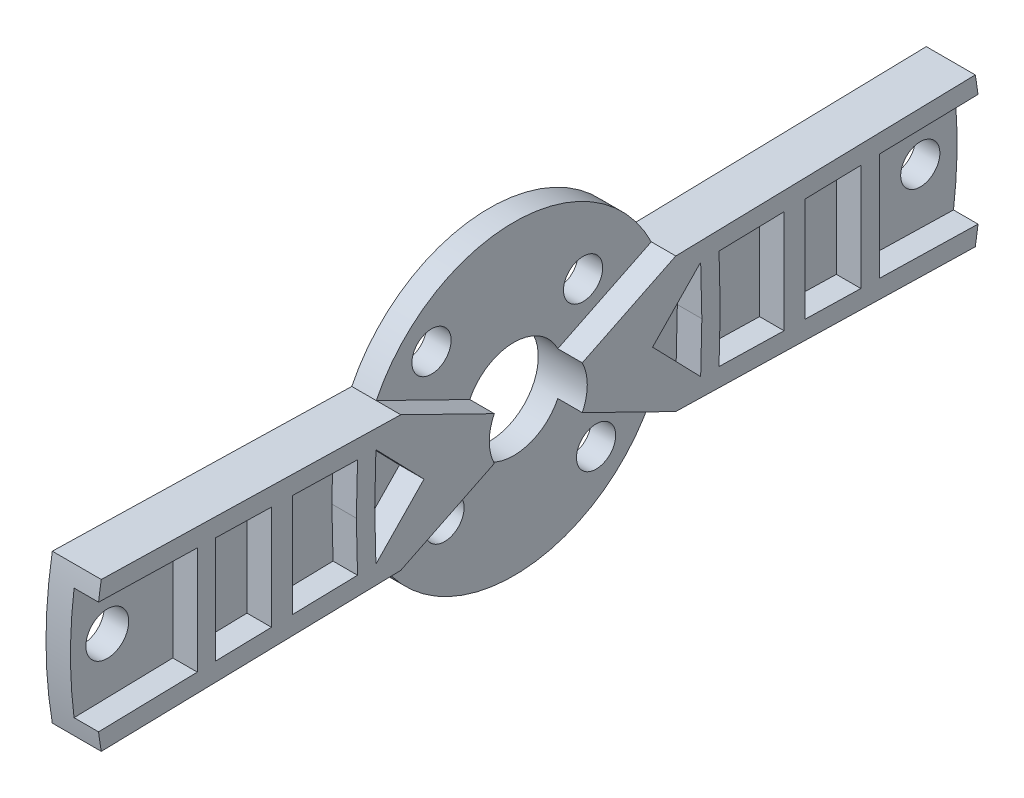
ISO-10303-21;
HEADER;
FILE_DESCRIPTION(('STEP AP214'),'2;1');
FILE_NAME('part.step','',(''),(''),'','','');
FILE_SCHEMA(('AUTOMOTIVE_DESIGN { 1 0 10303 214 1 1 1 1 }'));
ENDSEC;
DATA;
#1=APPLICATION_CONTEXT('core data for automotive mechanical design processes');
#2=APPLICATION_PROTOCOL_DEFINITION('international standard','automotive_design',2000,#1);
#3=PRODUCT_CONTEXT('',#1,'mechanical');
#4=PRODUCT('Part','Part','',(#3));
#5=PRODUCT_RELATED_PRODUCT_CATEGORY('part','',(#4));
#6=PRODUCT_DEFINITION_FORMATION('','',#4);
#7=PRODUCT_DEFINITION_CONTEXT('part definition',#1,'design');
#8=PRODUCT_DEFINITION('design','',#6,#7);
#9=PRODUCT_DEFINITION_SHAPE('','',#8);
#10=(LENGTH_UNIT() NAMED_UNIT(*) SI_UNIT(.MILLI.,.METRE.));
#11=(NAMED_UNIT(*) PLANE_ANGLE_UNIT() SI_UNIT($,.RADIAN.));
#12=(NAMED_UNIT(*) SI_UNIT($,.STERADIAN.) SOLID_ANGLE_UNIT());
#13=UNCERTAINTY_MEASURE_WITH_UNIT(LENGTH_MEASURE(1.E-05),#10,'distance_accuracy_value','');
#14=(GEOMETRIC_REPRESENTATION_CONTEXT(3) GLOBAL_UNCERTAINTY_ASSIGNED_CONTEXT((#13)) GLOBAL_UNIT_ASSIGNED_CONTEXT((#10,
#11,#12)) REPRESENTATION_CONTEXT('',''));
#15=CARTESIAN_POINT('',(0.,0.,0.));
#16=DIRECTION('',(0.,0.,1.));
#17=DIRECTION('',(1.,0.,0.));
#18=AXIS2_PLACEMENT_3D('',#15,#16,#17);
#19=CARTESIAN_POINT('',(34.9,0.,0.));
#20=DIRECTION('',(-1.,0.,0.));
#21=DIRECTION('',(0.,0.,1.));
#22=AXIS2_PLACEMENT_3D('',#19,#20,#21);
#23=PLANE('',#22);
#24=DIRECTION('',(0.,-0.999721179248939,-0.0236127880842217));
#25=VECTOR('',#24,1.);
#26=CARTESIAN_POINT('',(34.9,0.315186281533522,-13.3443962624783));
#27=LINE('',#26,#25);
#28=CARTESIAN_POINT('',(34.9,4.04755892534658,-13.2562399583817));
#29=VERTEX_POINT('',#28);
#30=CARTESIAN_POINT('',(34.9,0.,-13.351840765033));
#31=VERTEX_POINT('',#30);
#32=EDGE_CURVE('E387',#29,#31,#27,.T.);
#33=ORIENTED_EDGE('',*,*,#32,.F.);
#34=DIRECTION('',(0.,-0.717855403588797,0.69619222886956));
#35=VECTOR('',#34,1.);
#36=CARTESIAN_POINT('',(34.9,-4.66322393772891,-4.80832787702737));
#37=LINE('',#36,#35);
#38=CARTESIAN_POINT('',(34.9,0.,-9.33082676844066));
#39=VERTEX_POINT('',#38);
#40=EDGE_CURVE('E345',#29,#39,#37,.T.);
#41=ORIENTED_EDGE('',*,*,#40,.T.);
#42=DIRECTION('',(0.,0.717855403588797,0.69619222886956));
#43=VECTOR('',#42,1.);
#44=CARTESIAN_POINT('',(34.9,4.66322393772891,-4.80832787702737));
#45=LINE('',#44,#43);
#46=CARTESIAN_POINT('',(34.9,-4.04755892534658,-13.2562399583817));
#47=VERTEX_POINT('',#46);
#48=EDGE_CURVE('E348',#47,#39,#45,.T.);
#49=ORIENTED_EDGE('',*,*,#48,.F.);
#50=DIRECTION('',(0.,0.999721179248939,-0.0236127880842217));
#51=VECTOR('',#50,1.);
#52=CARTESIAN_POINT('',(34.9,-0.315186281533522,-13.3443962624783));
#53=LINE('',#52,#51);
#54=EDGE_CURVE('E417',#47,#31,#53,.T.);
#55=ORIENTED_EDGE('',*,*,#54,.T.);
#56=EDGE_LOOP('',(#33,#41,#49,#55));
#57=FACE_BOUND('',#56,.T.);
#58=ADVANCED_FACE('F34',(#57),#23,.F.);
#59=DIRECTION('',(0.,-0.0236127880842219,0.999721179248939));
#60=VECTOR('',#59,1.);
#61=CARTESIAN_POINT('',(34.9,3.73237264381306,0.0881563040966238));
#62=LINE('',#61,#60);
#63=CARTESIAN_POINT('',(34.9,4.20837590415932,-20.0649293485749));
#64=VERTEX_POINT('',#63);
#65=CARTESIAN_POINT('',(34.9,4.08296823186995,-14.75540361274));
#66=VERTEX_POINT('',#65);
#67=EDGE_CURVE('E392',#64,#66,#62,.T.);
#68=ORIENTED_EDGE('',*,*,#67,.T.);
#69=DIRECTION('',(0.,-0.999721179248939,-0.0236127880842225));
#70=VECTOR('',#69,1.);
#71=CARTESIAN_POINT('',(34.9,0.350595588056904,-14.8435599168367));
#72=LINE('',#71,#70);
#73=CARTESIAN_POINT('',(34.9,0.,-14.851840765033));
#74=VERTEX_POINT('',#73);
#75=EDGE_CURVE('E389',#66,#74,#72,.T.);
#76=ORIENTED_EDGE('',*,*,#75,.T.);
#77=DIRECTION('',(0.,0.999721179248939,-0.0236127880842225));
#78=VECTOR('',#77,1.);
#79=CARTESIAN_POINT('',(34.9,-0.350595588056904,-14.8435599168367));
#80=LINE('',#79,#78);
#81=CARTESIAN_POINT('',(34.9,-4.08296823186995,-14.75540361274));
#82=VERTEX_POINT('',#81);
#83=EDGE_CURVE('E461',#82,#74,#80,.T.);
#84=ORIENTED_EDGE('',*,*,#83,.F.);
#85=DIRECTION('',(0.,0.0236127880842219,0.999721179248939));
#86=VECTOR('',#85,1.);
#87=CARTESIAN_POINT('',(34.9,-3.73237264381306,0.0881563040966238));
#88=LINE('',#87,#86);
#89=CARTESIAN_POINT('',(34.9,-4.20837590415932,-20.0649293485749));
#90=VERTEX_POINT('',#89);
#91=EDGE_CURVE('E453',#90,#82,#88,.T.);
#92=ORIENTED_EDGE('',*,*,#91,.F.);
#93=DIRECTION('',(0.,1.,0.));
#94=VECTOR('',#93,1.);
#95=CARTESIAN_POINT('',(34.9,0.,-20.0649293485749));
#96=LINE('',#95,#94);
#97=EDGE_CURVE('E459',#90,#64,#96,.T.);
#98=ORIENTED_EDGE('',*,*,#97,.T.);
#99=EDGE_LOOP('',(#68,#76,#84,#92,#98));
#100=FACE_BOUND('',#99,.T.);
#101=ADVANCED_FACE('F851',(#100),#23,.F.);
#102=CARTESIAN_POINT('',(34.9,4.35647952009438,-26.3353587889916));
#103=VERTEX_POINT('',#102);
#104=CARTESIAN_POINT('',(34.9,4.24888924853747,-21.7801883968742));
#105=VERTEX_POINT('',#104);
#106=EDGE_CURVE('E394',#103,#105,#62,.T.);
#107=ORIENTED_EDGE('',*,*,#106,.T.);
#108=DIRECTION('',(0.,1.,0.));
#109=VECTOR('',#108,1.);
#110=CARTESIAN_POINT('',(34.9,0.,-21.7801883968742));
#111=LINE('',#110,#109);
#112=CARTESIAN_POINT('',(34.9,-4.24888924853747,-21.7801883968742));
#113=VERTEX_POINT('',#112);
#114=EDGE_CURVE('E457',#113,#105,#111,.T.);
#115=ORIENTED_EDGE('',*,*,#114,.F.);
#116=CARTESIAN_POINT('',(34.9,-4.35647952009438,-26.3353587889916));
#117=VERTEX_POINT('',#116);
#118=EDGE_CURVE('E57',#117,#113,#88,.T.);
#119=ORIENTED_EDGE('',*,*,#118,.F.);
#120=DIRECTION('',(0.,1.,0.));
#121=VECTOR('',#120,1.);
#122=CARTESIAN_POINT('',(34.9,0.,-26.3353587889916));
#123=LINE('',#122,#121);
#124=EDGE_CURVE('E455',#117,#103,#123,.T.);
#125=ORIENTED_EDGE('',*,*,#124,.T.);
#126=EDGE_LOOP('',(#107,#115,#119,#125));
#127=FACE_BOUND('',#126,.T.);
#128=ADVANCED_FACE('F857',(#127),#23,.F.);
#129=CARTESIAN_POINT('',(34.9,6.71751442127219,6.71751442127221));
#130=DIRECTION('',(-1.,0.,0.));
#131=DIRECTION('',(0.,0.,1.));
#132=AXIS2_PLACEMENT_3D('',#129,#130,#131);
#133=CIRCLE('',#132,1.6);
#134=CARTESIAN_POINT('',(34.9,6.71751442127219,8.31751442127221));
#135=VERTEX_POINT('',#134);
#136=EDGE_CURVE('E669',#135,#135,#133,.F.);
#137=ORIENTED_EDGE('',*,*,#136,.F.);
#138=EDGE_LOOP('',(#137));
#139=FACE_BOUND('',#138,.T.);
#140=CARTESIAN_POINT('',(34.9,5.65685424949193,-5.65685424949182));
#141=DIRECTION('',(-1.,0.,0.));
#142=DIRECTION('',(0.,0.,1.));
#143=AXIS2_PLACEMENT_3D('',#140,#141,#142);
#144=CIRCLE('',#143,1.6);
#145=CARTESIAN_POINT('',(34.9,5.65685424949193,-4.05685424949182));
#146=VERTEX_POINT('',#145);
#147=EDGE_CURVE('E660',#146,#146,#144,.F.);
#148=ORIENTED_EDGE('',*,*,#147,.F.);
#149=EDGE_LOOP('',(#148));
#150=FACE_BOUND('',#149,.T.);
#151=DIRECTION('',(0.,-0.44,0.897997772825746));
#152=VECTOR('',#151,1.);
#153=CARTESIAN_POINT('',(34.9,0.,0.));
#154=LINE('',#153,#152);
#155=CARTESIAN_POINT('',(34.9,5.5,-11.2249721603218));
#156=VERTEX_POINT('',#155);
#157=CARTESIAN_POINT('',(34.9,1.76,-3.59199109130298));
#158=VERTEX_POINT('',#157);
#159=EDGE_CURVE('E366',#156,#158,#154,.T.);
#160=ORIENTED_EDGE('',*,*,#159,.F.);
#161=CARTESIAN_POINT('',(34.9,0.,0.));
#162=DIRECTION('',(-1.,0.,0.));
#163=DIRECTION('',(0.,0.,1.));
#164=AXIS2_PLACEMENT_3D('',#161,#162,#163);
#165=CIRCLE('',#164,12.5);
#166=CARTESIAN_POINT('',(34.9,5.5,11.2249721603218));
#167=VERTEX_POINT('',#166);
#168=EDGE_CURVE('E704',#167,#156,#165,.T.);
#169=ORIENTED_EDGE('',*,*,#168,.F.);
#170=DIRECTION('',(0.,-0.44,-0.897997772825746));
#171=VECTOR('',#170,1.);
#172=CARTESIAN_POINT('',(34.9,0.,0.));
#173=LINE('',#172,#171);
#174=CARTESIAN_POINT('',(34.9,1.76,3.59199109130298));
#175=VERTEX_POINT('',#174);
#176=EDGE_CURVE('E524',#167,#175,#173,.T.);
#177=ORIENTED_EDGE('',*,*,#176,.T.);
#178=CARTESIAN_POINT('',(34.9,0.,0.));
#179=DIRECTION('',(-1.,0.,0.));
#180=DIRECTION('',(0.,0.,1.));
#181=AXIS2_PLACEMENT_3D('',#178,#179,#180);
#182=CIRCLE('',#181,4.);
#183=EDGE_CURVE('E677',#175,#158,#182,.T.);
#184=ORIENTED_EDGE('',*,*,#183,.T.);
#185=EDGE_LOOP('',(#160,#169,#177,#184));
#186=FACE_BOUND('',#185,.T.);
#187=ADVANCED_FACE('F743',(#139,#150,#186),#23,.F.);
#188=CARTESIAN_POINT('',(34.9,0.,-33.1843755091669));
#189=DIRECTION('',(-1.,0.,0.));
#190=DIRECTION('',(0.,0.,1.));
#191=AXIS2_PLACEMENT_3D('',#188,#189,#190);
#192=CIRCLE('',#191,1.6);
#193=CARTESIAN_POINT('',(34.9,0.,-31.5843755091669));
#194=VERTEX_POINT('',#193);
#195=EDGE_CURVE('E715',#194,#194,#192,.F.);
#196=ORIENTED_EDGE('',*,*,#195,.F.);
#197=EDGE_LOOP('',(#196));
#198=FACE_BOUND('',#197,.T.);
#199=CARTESIAN_POINT('',(34.9,4.58231018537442,-35.8966057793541));
#200=VERTEX_POINT('',#199);
#201=CARTESIAN_POINT('',(34.9,4.39190858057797,-27.8353587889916));
#202=VERTEX_POINT('',#201);
#203=EDGE_CURVE('E368',#200,#202,#62,.T.);
#204=ORIENTED_EDGE('',*,*,#203,.T.);
#205=DIRECTION('',(0.,1.,0.));
#206=VECTOR('',#205,1.);
#207=CARTESIAN_POINT('',(34.9,0.,-27.8353587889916));
#208=LINE('',#207,#206);
#209=CARTESIAN_POINT('',(34.9,-4.39190858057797,-27.8353587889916));
#210=VERTEX_POINT('',#209);
#211=EDGE_CURVE('E49',#210,#202,#208,.T.);
#212=ORIENTED_EDGE('',*,*,#211,.F.);
#213=CARTESIAN_POINT('',(34.9,-4.58231018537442,-35.8966057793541));
#214=VERTEX_POINT('',#213);
#215=EDGE_CURVE('E451',#214,#210,#88,.T.);
#216=ORIENTED_EDGE('',*,*,#215,.F.);
#217=CARTESIAN_POINT('',(34.9,0.,0.));
#218=DIRECTION('',(-1.,0.,0.));
#219=DIRECTION('',(0.,0.,1.));
#220=AXIS2_PLACEMENT_3D('',#217,#218,#219);
#221=CIRCLE('',#220,36.1878967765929);
#222=EDGE_CURVE('E707',#200,#214,#221,.T.);
#223=ORIENTED_EDGE('',*,*,#222,.F.);
#224=EDGE_LOOP('',(#204,#212,#216,#223));
#225=FACE_BOUND('',#224,.T.);
#226=ADVANCED_FACE('F922',(#198,#225),#23,.F.);
#227=CARTESIAN_POINT('',(34.9,0.,33.1843755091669));
#228=DIRECTION('',(-1.,0.,0.));
#229=DIRECTION('',(0.,0.,1.));
#230=AXIS2_PLACEMENT_3D('',#227,#228,#229);
#231=CIRCLE('',#230,1.75);
#232=CARTESIAN_POINT('',(34.9,0.,34.9343755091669));
#233=VERTEX_POINT('',#232);
#234=EDGE_CURVE('E712',#233,#233,#231,.F.);
#235=ORIENTED_EDGE('',*,*,#234,.F.);
#236=EDGE_LOOP('',(#235));
#237=FACE_BOUND('',#236,.T.);
#238=DIRECTION('',(0.,-0.0236127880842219,-0.999721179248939));
#239=VECTOR('',#238,1.);
#240=CARTESIAN_POINT('',(34.9,3.73237264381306,-0.0881563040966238));
#241=LINE('',#240,#239);
#242=CARTESIAN_POINT('',(34.9,4.58231018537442,35.8966057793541));
#243=VERTEX_POINT('',#242);
#244=CARTESIAN_POINT('',(34.9,4.39190858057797,27.8353587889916));
#245=VERTEX_POINT('',#244);
#246=EDGE_CURVE('E526',#243,#245,#241,.T.);
#247=ORIENTED_EDGE('',*,*,#246,.F.);
#248=CARTESIAN_POINT('',(34.9,0.,0.));
#249=DIRECTION('',(-1.,0.,0.));
#250=DIRECTION('',(0.,0.,1.));
#251=AXIS2_PLACEMENT_3D('',#248,#249,#250);
#252=CIRCLE('',#251,36.1878967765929);
#253=CARTESIAN_POINT('',(34.9,-4.58231018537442,35.8966057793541));
#254=VERTEX_POINT('',#253);
#255=EDGE_CURVE('E672',#243,#254,#252,.F.);
#256=ORIENTED_EDGE('',*,*,#255,.T.);
#257=DIRECTION('',(0.,0.0236127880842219,-0.999721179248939));
#258=VECTOR('',#257,1.);
#259=CARTESIAN_POINT('',(34.9,-3.73237264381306,-0.0881563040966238));
#260=LINE('',#259,#258);
#261=CARTESIAN_POINT('',(34.9,-4.39190858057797,27.8353587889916));
#262=VERTEX_POINT('',#261);
#263=EDGE_CURVE('E602',#254,#262,#260,.T.);
#264=ORIENTED_EDGE('',*,*,#263,.T.);
#265=DIRECTION('',(0.,1.,0.));
#266=VECTOR('',#265,1.);
#267=CARTESIAN_POINT('',(34.9,0.,27.8353587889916));
#268=LINE('',#267,#266);
#269=EDGE_CURVE('E609',#262,#245,#268,.T.);
#270=ORIENTED_EDGE('',*,*,#269,.T.);
#271=EDGE_LOOP('',(#247,#256,#264,#270));
#272=FACE_BOUND('',#271,.T.);
#273=ADVANCED_FACE('F929',(#237,#272),#23,.F.);
#274=CARTESIAN_POINT('',(34.9,-6.71751442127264,-6.71751442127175));
#275=DIRECTION('',(-1.,0.,0.));
#276=DIRECTION('',(0.,0.,1.));
#277=AXIS2_PLACEMENT_3D('',#274,#275,#276);
#278=CIRCLE('',#277,1.6);
#279=CARTESIAN_POINT('',(34.9,-6.71751442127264,-5.11751442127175));
#280=VERTEX_POINT('',#279);
#281=EDGE_CURVE('E653',#280,#280,#278,.F.);
#282=ORIENTED_EDGE('',*,*,#281,.F.);
#283=EDGE_LOOP('',(#282));
#284=FACE_BOUND('',#283,.T.);
#285=CARTESIAN_POINT('',(34.9,-5.65685424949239,5.65685424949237));
#286=DIRECTION('',(-1.,0.,0.));
#287=DIRECTION('',(0.,0.,1.));
#288=AXIS2_PLACEMENT_3D('',#285,#286,#287);
#289=CIRCLE('',#288,1.6);
#290=CARTESIAN_POINT('',(34.9,-5.65685424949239,7.25685424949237));
#291=VERTEX_POINT('',#290);
#292=EDGE_CURVE('E652',#291,#291,#289,.F.);
#293=ORIENTED_EDGE('',*,*,#292,.F.);
#294=EDGE_LOOP('',(#293));
#295=FACE_BOUND('',#294,.T.);
#296=CARTESIAN_POINT('',(34.9,0.,0.));
#297=DIRECTION('',(-1.,0.,0.));
#298=DIRECTION('',(0.,0.,1.));
#299=AXIS2_PLACEMENT_3D('',#296,#297,#298);
#300=CIRCLE('',#299,12.5);
#301=CARTESIAN_POINT('',(34.9,-5.50000000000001,-11.2249721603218));
#302=VERTEX_POINT('',#301);
#303=CARTESIAN_POINT('',(34.9,-5.5,11.2249721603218));
#304=VERTEX_POINT('',#303);
#305=EDGE_CURVE('E709',#302,#304,#300,.T.);
#306=ORIENTED_EDGE('',*,*,#305,.F.);
#307=DIRECTION('',(0.,0.44,0.897997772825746));
#308=VECTOR('',#307,1.);
#309=CARTESIAN_POINT('',(34.9,0.,0.));
#310=LINE('',#309,#308);
#311=CARTESIAN_POINT('',(34.9,-1.76,-3.59199109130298));
#312=VERTEX_POINT('',#311);
#313=EDGE_CURVE('E448',#302,#312,#310,.T.);
#314=ORIENTED_EDGE('',*,*,#313,.T.);
#315=CARTESIAN_POINT('',(34.9,-1.76,3.59199109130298));
#316=VERTEX_POINT('',#315);
#317=EDGE_CURVE('E718',#312,#316,#182,.T.);
#318=ORIENTED_EDGE('',*,*,#317,.T.);
#319=DIRECTION('',(0.,0.44,-0.897997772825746));
#320=VECTOR('',#319,1.);
#321=CARTESIAN_POINT('',(34.9,0.,0.));
#322=LINE('',#321,#320);
#323=EDGE_CURVE('E565',#304,#316,#322,.T.);
#324=ORIENTED_EDGE('',*,*,#323,.F.);
#325=EDGE_LOOP('',(#306,#314,#318,#324));
#326=FACE_BOUND('',#325,.T.);
#327=ADVANCED_FACE('F871',(#284,#295,#326),#23,.F.);
#328=CARTESIAN_POINT('',(34.9,4.35647952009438,26.3353587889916));
#329=VERTEX_POINT('',#328);
#330=CARTESIAN_POINT('',(34.9,4.24888924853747,21.7801883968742));
#331=VERTEX_POINT('',#330);
#332=EDGE_CURVE('E529',#329,#331,#241,.T.);
#333=ORIENTED_EDGE('',*,*,#332,.F.);
#334=DIRECTION('',(0.,1.,0.));
#335=VECTOR('',#334,1.);
#336=CARTESIAN_POINT('',(34.9,0.,26.3353587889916));
#337=LINE('',#336,#335);
#338=CARTESIAN_POINT('',(34.9,-4.35647952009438,26.3353587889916));
#339=VERTEX_POINT('',#338);
#340=EDGE_CURVE('E607',#339,#329,#337,.T.);
#341=ORIENTED_EDGE('',*,*,#340,.F.);
#342=CARTESIAN_POINT('',(34.9,-4.24888924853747,21.7801883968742));
#343=VERTEX_POINT('',#342);
#344=EDGE_CURVE('E603',#339,#343,#260,.T.);
#345=ORIENTED_EDGE('',*,*,#344,.T.);
#346=DIRECTION('',(0.,1.,0.));
#347=VECTOR('',#346,1.);
#348=CARTESIAN_POINT('',(34.9,0.,21.7801883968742));
#349=LINE('',#348,#347);
#350=EDGE_CURVE('E605',#343,#331,#349,.T.);
#351=ORIENTED_EDGE('',*,*,#350,.T.);
#352=EDGE_LOOP('',(#333,#341,#345,#351));
#353=FACE_BOUND('',#352,.T.);
#354=ADVANCED_FACE('F810',(#353),#23,.F.);
#355=DIRECTION('',(0.,-0.717855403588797,-0.69619222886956));
#356=VECTOR('',#355,1.);
#357=CARTESIAN_POINT('',(34.9,-4.66322393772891,4.80832787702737));
#358=LINE('',#357,#356);
#359=CARTESIAN_POINT('',(34.9,4.04755892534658,13.2562399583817));
#360=VERTEX_POINT('',#359);
#361=CARTESIAN_POINT('',(34.9,0.,9.33082676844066));
#362=VERTEX_POINT('',#361);
#363=EDGE_CURVE('E496',#360,#362,#358,.T.);
#364=ORIENTED_EDGE('',*,*,#363,.F.);
#365=DIRECTION('',(0.,-0.999721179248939,0.0236127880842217));
#366=VECTOR('',#365,1.);
#367=CARTESIAN_POINT('',(34.9,0.315186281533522,13.3443962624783));
#368=LINE('',#367,#366);
#369=CARTESIAN_POINT('',(34.9,0.,13.351840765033));
#370=VERTEX_POINT('',#369);
#371=EDGE_CURVE('E501',#360,#370,#368,.T.);
#372=ORIENTED_EDGE('',*,*,#371,.T.);
#373=DIRECTION('',(0.,0.999721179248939,0.0236127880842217));
#374=VECTOR('',#373,1.);
#375=CARTESIAN_POINT('',(34.9,-0.315186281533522,13.3443962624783));
#376=LINE('',#375,#374);
#377=CARTESIAN_POINT('',(34.9,-4.04755892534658,13.2562399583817));
#378=VERTEX_POINT('',#377);
#379=EDGE_CURVE('E594',#378,#370,#376,.T.);
#380=ORIENTED_EDGE('',*,*,#379,.F.);
#381=DIRECTION('',(0.,0.717855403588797,-0.69619222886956));
#382=VECTOR('',#381,1.);
#383=CARTESIAN_POINT('',(34.9,4.66322393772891,4.80832787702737));
#384=LINE('',#383,#382);
#385=EDGE_CURVE('E561',#378,#362,#384,.T.);
#386=ORIENTED_EDGE('',*,*,#385,.T.);
#387=EDGE_LOOP('',(#364,#372,#380,#386));
#388=FACE_BOUND('',#387,.T.);
#389=ADVANCED_FACE('F862',(#388),#23,.F.);
#390=CARTESIAN_POINT('',(34.9,4.20837590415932,20.0649293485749));
#391=VERTEX_POINT('',#390);
#392=CARTESIAN_POINT('',(34.9,4.08296823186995,14.75540361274));
#393=VERTEX_POINT('',#392);
#394=EDGE_CURVE('E530',#391,#393,#241,.T.);
#395=ORIENTED_EDGE('',*,*,#394,.F.);
#396=DIRECTION('',(0.,1.,0.));
#397=VECTOR('',#396,1.);
#398=CARTESIAN_POINT('',(34.9,0.,20.0649293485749));
#399=LINE('',#398,#397);
#400=CARTESIAN_POINT('',(34.9,-4.20837590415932,20.0649293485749));
#401=VERTEX_POINT('',#400);
#402=EDGE_CURVE('E601',#401,#391,#399,.T.);
#403=ORIENTED_EDGE('',*,*,#402,.F.);
#404=CARTESIAN_POINT('',(34.9,-4.08296823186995,14.75540361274));
#405=VERTEX_POINT('',#404);
#406=EDGE_CURVE('E599',#401,#405,#260,.T.);
#407=ORIENTED_EDGE('',*,*,#406,.T.);
#408=DIRECTION('',(0.,0.999721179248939,0.0236127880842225));
#409=VECTOR('',#408,1.);
#410=CARTESIAN_POINT('',(34.9,-0.350595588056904,14.8435599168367));
#411=LINE('',#410,#409);
#412=CARTESIAN_POINT('',(34.9,0.,14.851840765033));
#413=VERTEX_POINT('',#412);
#414=EDGE_CURVE('E597',#405,#413,#411,.T.);
#415=ORIENTED_EDGE('',*,*,#414,.T.);
#416=DIRECTION('',(0.,-0.999721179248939,0.0236127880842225));
#417=VECTOR('',#416,1.);
#418=CARTESIAN_POINT('',(34.9,0.350595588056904,14.8435599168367));
#419=LINE('',#418,#417);
#420=EDGE_CURVE('E531',#393,#413,#419,.T.);
#421=ORIENTED_EDGE('',*,*,#420,.F.);
#422=EDGE_LOOP('',(#395,#403,#407,#415,#421));
#423=FACE_BOUND('',#422,.T.);
#424=ADVANCED_FACE('F832',(#423),#23,.F.);
#425=CARTESIAN_POINT('',(32.9,0.,0.));
#426=DIRECTION('',(1.,0.,0.));
#427=DIRECTION('',(0.,0.,-1.));
#428=AXIS2_PLACEMENT_3D('',#425,#426,#427);
#429=CYLINDRICAL_SURFACE('',#428,36.1878967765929);
#430=ORIENTED_EDGE('',*,*,#255,.F.);
#431=DIRECTION('',(-1.,0.,0.));
#432=VECTOR('',#431,1.);
#433=CARTESIAN_POINT('',(36.9,4.58231018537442,35.8966057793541));
#434=LINE('',#433,#432);
#435=CARTESIAN_POINT('',(36.9,4.58231018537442,35.8966057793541));
#436=VERTEX_POINT('',#435);
#437=EDGE_CURVE('E552',#436,#243,#434,.T.);
#438=ORIENTED_EDGE('',*,*,#437,.F.);
#439=CARTESIAN_POINT('',(36.9,0.,0.));
#440=DIRECTION('',(-1.,0.,0.));
#441=DIRECTION('',(0.,0.,-1.));
#442=AXIS2_PLACEMENT_3D('',#439,#440,#441);
#443=CIRCLE('',#442,36.1878967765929);
#444=CARTESIAN_POINT('',(36.9,6.07746872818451,35.67391549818));
#445=VERTEX_POINT('',#444);
#446=EDGE_CURVE('E507',#436,#445,#443,.T.);
#447=ORIENTED_EDGE('',*,*,#446,.T.);
#448=DIRECTION('',(1.,0.,0.));
#449=VECTOR('',#448,1.);
#450=CARTESIAN_POINT('',(32.9,6.07746872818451,35.6739154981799));
#451=LINE('',#450,#449);
#452=CARTESIAN_POINT('',(32.9,6.07746872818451,35.6739154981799));
#453=VERTEX_POINT('',#452);
#454=EDGE_CURVE('E11',#453,#445,#451,.T.);
#455=ORIENTED_EDGE('',*,*,#454,.F.);
#456=CARTESIAN_POINT('',(32.9,0.,0.));
#457=DIRECTION('',(-1.,0.,0.));
#458=DIRECTION('',(0.,0.,1.));
#459=AXIS2_PLACEMENT_3D('',#456,#457,#458);
#460=CIRCLE('',#459,36.1878967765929);
#461=CARTESIAN_POINT('',(32.9,-6.07746872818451,35.6739154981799));
#462=VERTEX_POINT('',#461);
#463=EDGE_CURVE('E673',#453,#462,#460,.F.);
#464=ORIENTED_EDGE('',*,*,#463,.T.);
#465=DIRECTION('',(1.,0.,0.));
#466=VECTOR('',#465,1.);
#467=CARTESIAN_POINT('',(32.9,-6.07746872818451,35.6739154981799));
#468=LINE('',#467,#466);
#469=CARTESIAN_POINT('',(36.9,-6.07746872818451,35.67391549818));
#470=VERTEX_POINT('',#469);
#471=EDGE_CURVE('E702',#462,#470,#468,.T.);
#472=ORIENTED_EDGE('',*,*,#471,.T.);
#473=CARTESIAN_POINT('',(36.9,0.,0.));
#474=DIRECTION('',(1.,0.,0.));
#475=DIRECTION('',(0.,0.,-1.));
#476=AXIS2_PLACEMENT_3D('',#473,#474,#475);
#477=CIRCLE('',#476,36.1878967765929);
#478=CARTESIAN_POINT('',(36.9,-4.58231018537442,35.8966057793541));
#479=VERTEX_POINT('',#478);
#480=EDGE_CURVE('E583',#479,#470,#477,.T.);
#481=ORIENTED_EDGE('',*,*,#480,.F.);
#482=DIRECTION('',(-1.,0.,0.));
#483=VECTOR('',#482,1.);
#484=CARTESIAN_POINT('',(36.9,-4.58231018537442,35.8966057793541));
#485=LINE('',#484,#483);
#486=EDGE_CURVE('E621',#479,#254,#485,.T.);
#487=ORIENTED_EDGE('',*,*,#486,.T.);
#488=EDGE_LOOP('',(#430,#438,#447,#455,#464,#472,#481,#487));
#489=FACE_BOUND('',#488,.T.);
#490=ADVANCED_FACE('F36',(#489),#429,.T.);
#491=CARTESIAN_POINT('',(32.9,5.23195441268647,-0.123575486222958));
#492=DIRECTION('',(0.,-0.999721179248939,0.0236127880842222));
#493=DIRECTION('',(0.,-0.0236127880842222,-0.999721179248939));
#494=AXIS2_PLACEMENT_3D('',#491,#492,#493);
#495=PLANE('',#494);
#496=ORIENTED_EDGE('',*,*,#454,.T.);
#497=DIRECTION('',(0.,-0.0236127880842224,-0.999721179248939));
#498=VECTOR('',#497,1.);
#499=CARTESIAN_POINT('',(36.9,5.23195441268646,-0.123575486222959));
#500=LINE('',#499,#498);
#501=CARTESIAN_POINT('',(36.9,5.5,11.2249721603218));
#502=VERTEX_POINT('',#501);
#503=EDGE_CURVE('E504',#445,#502,#500,.T.);
#504=ORIENTED_EDGE('',*,*,#503,.T.);
#505=DIRECTION('',(-1.,0.,0.));
#506=VECTOR('',#505,1.);
#507=CARTESIAN_POINT('',(36.9,5.5,11.2249721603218));
#508=LINE('',#507,#506);
#509=EDGE_CURVE('E555',#502,#167,#508,.T.);
#510=ORIENTED_EDGE('',*,*,#509,.T.);
#511=DIRECTION('',(1.,0.,0.));
#512=VECTOR('',#511,1.);
#513=CARTESIAN_POINT('',(32.9,5.5,11.2249721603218));
#514=LINE('',#513,#512);
#515=CARTESIAN_POINT('',(32.9,5.5,11.2249721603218));
#516=VERTEX_POINT('',#515);
#517=EDGE_CURVE('E42',#516,#167,#514,.T.);
#518=ORIENTED_EDGE('',*,*,#517,.F.);
#519=DIRECTION('',(0.,-0.0236127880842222,-0.999721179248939));
#520=VECTOR('',#519,1.);
#521=CARTESIAN_POINT('',(32.9,5.23195441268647,-0.123575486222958));
#522=LINE('',#521,#520);
#523=EDGE_CURVE('E676',#453,#516,#522,.T.);
#524=ORIENTED_EDGE('',*,*,#523,.F.);
#525=EDGE_LOOP('',(#496,#504,#510,#518,#524));
#526=FACE_BOUND('',#525,.T.);
#527=ADVANCED_FACE('F746',(#526),#495,.F.);
#528=CARTESIAN_POINT('',(32.9,0.,0.));
#529=DIRECTION('',(1.,0.,0.));
#530=DIRECTION('',(0.,0.,-1.));
#531=AXIS2_PLACEMENT_3D('',#528,#529,#530);
#532=CYLINDRICAL_SURFACE('',#531,12.5);
#533=ORIENTED_EDGE('',*,*,#168,.T.);
#534=DIRECTION('',(1.,0.,0.));
#535=VECTOR('',#534,1.);
#536=CARTESIAN_POINT('',(32.9,5.5,-11.2249721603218));
#537=LINE('',#536,#535);
#538=CARTESIAN_POINT('',(32.9,5.5,-11.2249721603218));
#539=VERTEX_POINT('',#538);
#540=EDGE_CURVE('E731',#539,#156,#537,.T.);
#541=ORIENTED_EDGE('',*,*,#540,.F.);
#542=CARTESIAN_POINT('',(32.9,0.,0.));
#543=DIRECTION('',(-1.,0.,0.));
#544=DIRECTION('',(0.,0.,1.));
#545=AXIS2_PLACEMENT_3D('',#542,#543,#544);
#546=CIRCLE('',#545,12.5);
#547=EDGE_CURVE('E679',#516,#539,#546,.T.);
#548=ORIENTED_EDGE('',*,*,#547,.F.);
#549=ORIENTED_EDGE('',*,*,#517,.T.);
#550=EDGE_LOOP('',(#533,#541,#548,#549));
#551=FACE_BOUND('',#550,.T.);
#552=ADVANCED_FACE('F737',(#551),#532,.T.);
#553=CARTESIAN_POINT('',(32.9,5.23195441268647,0.123575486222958));
#554=DIRECTION('',(0.,0.999721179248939,0.0236127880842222));
#555=DIRECTION('',(0.,-0.0236127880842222,0.999721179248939));
#556=AXIS2_PLACEMENT_3D('',#553,#554,#555);
#557=PLANE('',#556);
#558=ORIENTED_EDGE('',*,*,#540,.T.);
#559=DIRECTION('',(-1.,0.,0.));
#560=VECTOR('',#559,1.);
#561=CARTESIAN_POINT('',(36.9,5.5,-11.2249721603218));
#562=LINE('',#561,#560);
#563=CARTESIAN_POINT('',(36.9,5.5,-11.2249721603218));
#564=VERTEX_POINT('',#563);
#565=EDGE_CURVE('E398',#564,#156,#562,.T.);
#566=ORIENTED_EDGE('',*,*,#565,.F.);
#567=DIRECTION('',(0.,-0.0236127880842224,0.999721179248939));
#568=VECTOR('',#567,1.);
#569=CARTESIAN_POINT('',(36.9,5.23195441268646,0.123575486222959));
#570=LINE('',#569,#568);
#571=CARTESIAN_POINT('',(36.9,6.07746872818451,-35.67391549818));
#572=VERTEX_POINT('',#571);
#573=EDGE_CURVE('E380',#572,#564,#570,.T.);
#574=ORIENTED_EDGE('',*,*,#573,.F.);
#575=DIRECTION('',(1.,0.,0.));
#576=VECTOR('',#575,1.);
#577=CARTESIAN_POINT('',(32.9,6.07746872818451,-35.6739154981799));
#578=LINE('',#577,#576);
#579=CARTESIAN_POINT('',(32.9,6.07746872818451,-35.6739154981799));
#580=VERTEX_POINT('',#579);
#581=EDGE_CURVE('E729',#580,#572,#578,.T.);
#582=ORIENTED_EDGE('',*,*,#581,.F.);
#583=DIRECTION('',(0.,-0.0236127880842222,0.999721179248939));
#584=VECTOR('',#583,1.);
#585=CARTESIAN_POINT('',(32.9,5.23195441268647,0.123575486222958));
#586=LINE('',#585,#584);
#587=EDGE_CURVE('E681',#580,#539,#586,.T.);
#588=ORIENTED_EDGE('',*,*,#587,.T.);
#589=EDGE_LOOP('',(#558,#566,#574,#582,#588));
#590=FACE_BOUND('',#589,.T.);
#591=ADVANCED_FACE('F764',(#590),#557,.T.);
#592=CARTESIAN_POINT('',(32.9,0.,0.));
#593=DIRECTION('',(1.,0.,0.));
#594=DIRECTION('',(0.,0.,-1.));
#595=AXIS2_PLACEMENT_3D('',#592,#593,#594);
#596=CYLINDRICAL_SURFACE('',#595,36.1878967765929);
#597=ORIENTED_EDGE('',*,*,#581,.T.);
#598=CARTESIAN_POINT('',(36.9,0.,0.));
#599=DIRECTION('',(1.,0.,0.));
#600=DIRECTION('',(0.,0.,1.));
#601=AXIS2_PLACEMENT_3D('',#598,#599,#600);
#602=CIRCLE('',#601,36.1878967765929);
#603=CARTESIAN_POINT('',(36.9,4.58231018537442,-35.8966057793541));
#604=VERTEX_POINT('',#603);
#605=EDGE_CURVE('E377',#604,#572,#602,.T.);
#606=ORIENTED_EDGE('',*,*,#605,.F.);
#607=DIRECTION('',(-1.,0.,0.));
#608=VECTOR('',#607,1.);
#609=CARTESIAN_POINT('',(36.9,4.58231018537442,-35.8966057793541));
#610=LINE('',#609,#608);
#611=EDGE_CURVE('E400',#604,#200,#610,.T.);
#612=ORIENTED_EDGE('',*,*,#611,.T.);
#613=ORIENTED_EDGE('',*,*,#222,.T.);
#614=DIRECTION('',(-1.,0.,0.));
#615=VECTOR('',#614,1.);
#616=CARTESIAN_POINT('',(36.9,-4.58231018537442,-35.8966057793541));
#617=LINE('',#616,#615);
#618=CARTESIAN_POINT('',(36.9,-4.58231018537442,-35.8966057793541));
#619=VERTEX_POINT('',#618);
#620=EDGE_CURVE('E485',#619,#214,#617,.T.);
#621=ORIENTED_EDGE('',*,*,#620,.F.);
#622=CARTESIAN_POINT('',(36.9,0.,0.));
#623=DIRECTION('',(-1.,0.,0.));
#624=DIRECTION('',(0.,0.,1.));
#625=AXIS2_PLACEMENT_3D('',#622,#623,#624);
#626=CIRCLE('',#625,36.1878967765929);
#627=CARTESIAN_POINT('',(36.9,-6.07746872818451,-35.67391549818));
#628=VERTEX_POINT('',#627);
#629=EDGE_CURVE('E425',#619,#628,#626,.T.);
#630=ORIENTED_EDGE('',*,*,#629,.T.);
#631=DIRECTION('',(1.,0.,0.));
#632=VECTOR('',#631,1.);
#633=CARTESIAN_POINT('',(32.9,-6.07746872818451,-35.6739154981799));
#634=LINE('',#633,#632);
#635=CARTESIAN_POINT('',(32.9,-6.07746872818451,-35.6739154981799));
#636=VERTEX_POINT('',#635);
#637=EDGE_CURVE('E727',#636,#628,#634,.T.);
#638=ORIENTED_EDGE('',*,*,#637,.F.);
#639=CARTESIAN_POINT('',(32.9,0.,0.));
#640=DIRECTION('',(-1.,0.,0.));
#641=DIRECTION('',(0.,0.,1.));
#642=AXIS2_PLACEMENT_3D('',#639,#640,#641);
#643=CIRCLE('',#642,36.1878967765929);
#644=EDGE_CURVE('E684',#580,#636,#643,.T.);
#645=ORIENTED_EDGE('',*,*,#644,.F.);
#646=EDGE_LOOP('',(#597,#606,#612,#613,#621,#630,#638,#645));
#647=FACE_BOUND('',#646,.T.);
#648=ADVANCED_FACE('F955',(#647),#596,.T.);
#649=CARTESIAN_POINT('',(32.9,-5.23195441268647,0.123575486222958));
#650=DIRECTION('',(0.,0.999721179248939,-0.0236127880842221));
#651=DIRECTION('',(0.,0.0236127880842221,0.999721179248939));
#652=AXIS2_PLACEMENT_3D('',#649,#650,#651);
#653=PLANE('',#652);
#654=ORIENTED_EDGE('',*,*,#637,.T.);
#655=DIRECTION('',(0.,0.0236127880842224,0.999721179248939));
#656=VECTOR('',#655,1.);
#657=CARTESIAN_POINT('',(36.9,-5.23195441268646,0.123575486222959));
#658=LINE('',#657,#656);
#659=CARTESIAN_POINT('',(36.9,-5.5,-11.2249721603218));
#660=VERTEX_POINT('',#659);
#661=EDGE_CURVE('E422',#628,#660,#658,.T.);
#662=ORIENTED_EDGE('',*,*,#661,.T.);
#663=DIRECTION('',(-1.,0.,0.));
#664=VECTOR('',#663,1.);
#665=CARTESIAN_POINT('',(36.9,-5.5,-11.2249721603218));
#666=LINE('',#665,#664);
#667=EDGE_CURVE('E488',#660,#302,#666,.T.);
#668=ORIENTED_EDGE('',*,*,#667,.T.);
#669=DIRECTION('',(1.,0.,0.));
#670=VECTOR('',#669,1.);
#671=CARTESIAN_POINT('',(32.9,-5.50000000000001,-11.2249721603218));
#672=LINE('',#671,#670);
#673=CARTESIAN_POINT('',(32.9,-5.50000000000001,-11.2249721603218));
#674=VERTEX_POINT('',#673);
#675=EDGE_CURVE('E725',#674,#302,#672,.T.);
#676=ORIENTED_EDGE('',*,*,#675,.F.);
#677=DIRECTION('',(0.,0.0236127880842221,0.999721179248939));
#678=VECTOR('',#677,1.);
#679=CARTESIAN_POINT('',(32.9,-5.23195441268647,0.123575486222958));
#680=LINE('',#679,#678);
#681=EDGE_CURVE('E686',#636,#674,#680,.T.);
#682=ORIENTED_EDGE('',*,*,#681,.F.);
#683=EDGE_LOOP('',(#654,#662,#668,#676,#682));
#684=FACE_BOUND('',#683,.T.);
#685=ADVANCED_FACE('F1252',(#684),#653,.F.);
#686=CARTESIAN_POINT('',(32.9,0.,0.));
#687=DIRECTION('',(1.,0.,0.));
#688=DIRECTION('',(0.,0.,-1.));
#689=AXIS2_PLACEMENT_3D('',#686,#687,#688);
#690=CYLINDRICAL_SURFACE('',#689,12.5);
#691=ORIENTED_EDGE('',*,*,#305,.T.);
#692=DIRECTION('',(1.,0.,0.));
#693=VECTOR('',#692,1.);
#694=CARTESIAN_POINT('',(32.9,-5.5,11.2249721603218));
#695=LINE('',#694,#693);
#696=CARTESIAN_POINT('',(32.9,-5.5,11.2249721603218));
#697=VERTEX_POINT('',#696);
#698=EDGE_CURVE('E722',#697,#304,#695,.T.);
#699=ORIENTED_EDGE('',*,*,#698,.F.);
#700=CARTESIAN_POINT('',(32.9,0.,0.));
#701=DIRECTION('',(-1.,0.,0.));
#702=DIRECTION('',(0.,0.,1.));
#703=AXIS2_PLACEMENT_3D('',#700,#701,#702);
#704=CIRCLE('',#703,12.5);
#705=EDGE_CURVE('E688',#674,#697,#704,.T.);
#706=ORIENTED_EDGE('',*,*,#705,.F.);
#707=ORIENTED_EDGE('',*,*,#675,.T.);
#708=EDGE_LOOP('',(#691,#699,#706,#707));
#709=FACE_BOUND('',#708,.T.);
#710=ADVANCED_FACE('F1246',(#709),#690,.T.);
#711=CARTESIAN_POINT('',(32.9,0.,-33.1843755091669));
#712=DIRECTION('',(1.,0.,0.));
#713=DIRECTION('',(0.,0.,-1.));
#714=AXIS2_PLACEMENT_3D('',#711,#712,#713);
#715=CYLINDRICAL_SURFACE('',#714,1.6);
#716=CARTESIAN_POINT('',(32.9,0.,-33.1843755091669));
#717=DIRECTION('',(-1.,0.,0.));
#718=DIRECTION('',(0.,0.,1.));
#719=AXIS2_PLACEMENT_3D('',#716,#717,#718);
#720=CIRCLE('',#719,1.6);
#721=CARTESIAN_POINT('',(32.9,0.,-31.5843755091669));
#722=VERTEX_POINT('',#721);
#723=EDGE_CURVE('E696',#722,#722,#720,.F.);
#724=ORIENTED_EDGE('',*,*,#723,.F.);
#725=EDGE_LOOP('',(#724));
#726=FACE_BOUND('',#725,.T.);
#727=ORIENTED_EDGE('',*,*,#195,.T.);
#728=EDGE_LOOP('',(#727));
#729=FACE_BOUND('',#728,.T.);
#730=ADVANCED_FACE('F1251',(#726,#729),#715,.F.);
#731=CARTESIAN_POINT('',(32.9,0.,33.1843755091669));
#732=DIRECTION('',(1.,0.,0.));
#733=DIRECTION('',(0.,0.,-1.));
#734=AXIS2_PLACEMENT_3D('',#731,#732,#733);
#735=CYLINDRICAL_SURFACE('',#734,1.75);
#736=CARTESIAN_POINT('',(32.9,0.,33.1843755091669));
#737=DIRECTION('',(-1.,0.,0.));
#738=DIRECTION('',(0.,0.,1.));
#739=AXIS2_PLACEMENT_3D('',#736,#737,#738);
#740=CIRCLE('',#739,1.75);
#741=CARTESIAN_POINT('',(32.9,0.,34.9343755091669));
#742=VERTEX_POINT('',#741);
#743=EDGE_CURVE('E693',#742,#742,#740,.F.);
#744=ORIENTED_EDGE('',*,*,#743,.F.);
#745=EDGE_LOOP('',(#744));
#746=FACE_BOUND('',#745,.T.);
#747=ORIENTED_EDGE('',*,*,#234,.T.);
#748=EDGE_LOOP('',(#747));
#749=FACE_BOUND('',#748,.T.);
#750=ADVANCED_FACE('F1262',(#746,#749),#735,.F.);
#751=CARTESIAN_POINT('',(32.9,-5.23195441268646,-0.123575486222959));
#752=DIRECTION('',(0.,-0.999721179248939,-0.0236127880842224));
#753=DIRECTION('',(0.,0.0236127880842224,-0.999721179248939));
#754=AXIS2_PLACEMENT_3D('',#751,#752,#753);
#755=PLANE('',#754);
#756=ORIENTED_EDGE('',*,*,#698,.T.);
#757=DIRECTION('',(-1.,0.,0.));
#758=VECTOR('',#757,1.);
#759=CARTESIAN_POINT('',(36.9,-5.5,11.2249721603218));
#760=LINE('',#759,#758);
#761=CARTESIAN_POINT('',(36.9,-5.5,11.2249721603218));
#762=VERTEX_POINT('',#761);
#763=EDGE_CURVE('E618',#762,#304,#760,.T.);
#764=ORIENTED_EDGE('',*,*,#763,.F.);
#765=DIRECTION('',(0.,0.0236127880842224,-0.999721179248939));
#766=VECTOR('',#765,1.);
#767=CARTESIAN_POINT('',(36.9,-5.23195441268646,-0.123575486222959));
#768=LINE('',#767,#766);
#769=EDGE_CURVE('E586',#470,#762,#768,.T.);
#770=ORIENTED_EDGE('',*,*,#769,.F.);
#771=ORIENTED_EDGE('',*,*,#471,.F.);
#772=DIRECTION('',(0.,0.0236127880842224,-0.999721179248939));
#773=VECTOR('',#772,1.);
#774=CARTESIAN_POINT('',(32.9,-5.23195441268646,-0.123575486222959));
#775=LINE('',#774,#773);
#776=EDGE_CURVE('E690',#462,#697,#775,.T.);
#777=ORIENTED_EDGE('',*,*,#776,.T.);
#778=EDGE_LOOP('',(#756,#764,#770,#771,#777));
#779=FACE_BOUND('',#778,.T.);
#780=ADVANCED_FACE('F909',(#779),#755,.T.);
#781=CARTESIAN_POINT('',(32.9,0.,0.));
#782=DIRECTION('',(1.,0.,0.));
#783=DIRECTION('',(0.,0.,-1.));
#784=AXIS2_PLACEMENT_3D('',#781,#782,#783);
#785=CYLINDRICAL_SURFACE('',#784,4.);
#786=ORIENTED_EDGE('',*,*,#183,.F.);
#787=DIRECTION('',(-1.,0.,0.));
#788=VECTOR('',#787,1.);
#789=CARTESIAN_POINT('',(36.9,1.76,3.59199109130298));
#790=LINE('',#789,#788);
#791=CARTESIAN_POINT('',(36.9,1.76,3.59199109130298));
#792=VERTEX_POINT('',#791);
#793=EDGE_CURVE('E558',#792,#175,#790,.T.);
#794=ORIENTED_EDGE('',*,*,#793,.F.);
#795=CARTESIAN_POINT('',(36.9,0.,0.));
#796=DIRECTION('',(1.,0.,0.));
#797=DIRECTION('',(0.,0.,-1.));
#798=AXIS2_PLACEMENT_3D('',#795,#796,#797);
#799=CIRCLE('',#798,4.);
#800=CARTESIAN_POINT('',(36.9,-1.76,3.59199109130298));
#801=VERTEX_POINT('',#800);
#802=EDGE_CURVE('E590',#801,#792,#799,.F.);
#803=ORIENTED_EDGE('',*,*,#802,.F.);
#804=DIRECTION('',(-1.,0.,0.));
#805=VECTOR('',#804,1.);
#806=CARTESIAN_POINT('',(36.9,-1.76,3.59199109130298));
#807=LINE('',#806,#805);
#808=EDGE_CURVE('E615',#801,#316,#807,.T.);
#809=ORIENTED_EDGE('',*,*,#808,.T.);
#810=ORIENTED_EDGE('',*,*,#317,.F.);
#811=DIRECTION('',(-1.,0.,0.));
#812=VECTOR('',#811,1.);
#813=CARTESIAN_POINT('',(36.9,-1.76,-3.59199109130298));
#814=LINE('',#813,#812);
#815=CARTESIAN_POINT('',(36.9,-1.76,-3.59199109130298));
#816=VERTEX_POINT('',#815);
#817=EDGE_CURVE('E491',#816,#312,#814,.T.);
#818=ORIENTED_EDGE('',*,*,#817,.F.);
#819=CARTESIAN_POINT('',(36.9,0.,0.));
#820=DIRECTION('',(-1.,0.,0.));
#821=DIRECTION('',(0.,0.,1.));
#822=AXIS2_PLACEMENT_3D('',#819,#820,#821);
#823=CIRCLE('',#822,4.);
#824=CARTESIAN_POINT('',(36.9,1.76,-3.59199109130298));
#825=VERTEX_POINT('',#824);
#826=EDGE_CURVE('E416',#816,#825,#823,.F.);
#827=ORIENTED_EDGE('',*,*,#826,.T.);
#828=DIRECTION('',(-1.,0.,0.));
#829=VECTOR('',#828,1.);
#830=CARTESIAN_POINT('',(36.9,1.76,-3.59199109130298));
#831=LINE('',#830,#829);
#832=EDGE_CURVE('E385',#825,#158,#831,.T.);
#833=ORIENTED_EDGE('',*,*,#832,.T.);
#834=EDGE_LOOP('',(#786,#794,#803,#809,#810,#818,#827,#833));
#835=FACE_BOUND('',#834,.T.);
#836=CARTESIAN_POINT('',(32.9,0.,0.));
#837=DIRECTION('',(-1.,0.,0.));
#838=DIRECTION('',(0.,0.,1.));
#839=AXIS2_PLACEMENT_3D('',#836,#837,#838);
#840=CIRCLE('',#839,4.);
#841=CARTESIAN_POINT('',(32.9,0.,4.));
#842=VERTEX_POINT('',#841);
#843=EDGE_CURVE('E699',#842,#842,#840,.T.);
#844=ORIENTED_EDGE('',*,*,#843,.T.);
#845=EDGE_LOOP('',(#844));
#846=FACE_BOUND('',#845,.T.);
#847=ADVANCED_FACE('F754',(#835,#846),#785,.F.);
#848=CARTESIAN_POINT('',(32.9,0.,0.));
#849=DIRECTION('',(-1.,0.,0.));
#850=DIRECTION('',(0.,0.,1.));
#851=AXIS2_PLACEMENT_3D('',#848,#849,#850);
#852=PLANE('',#851);
#853=CARTESIAN_POINT('',(32.9,-5.65685424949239,5.65685424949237));
#854=DIRECTION('',(-1.,0.,0.));
#855=DIRECTION('',(0.,0.,1.));
#856=AXIS2_PLACEMENT_3D('',#853,#854,#855);
#857=CIRCLE('',#856,1.6);
#858=CARTESIAN_POINT('',(32.9,-5.65685424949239,7.25685424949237));
#859=VERTEX_POINT('',#858);
#860=EDGE_CURVE('E649',#859,#859,#857,.T.);
#861=ORIENTED_EDGE('',*,*,#860,.F.);
#862=EDGE_LOOP('',(#861));
#863=FACE_BOUND('',#862,.T.);
#864=CARTESIAN_POINT('',(32.9,-6.71751442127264,-6.71751442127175));
#865=DIRECTION('',(-1.,0.,0.));
#866=DIRECTION('',(0.,0.,1.));
#867=AXIS2_PLACEMENT_3D('',#864,#865,#866);
#868=CIRCLE('',#867,1.6);
#869=CARTESIAN_POINT('',(32.9,-6.71751442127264,-5.11751442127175));
#870=VERTEX_POINT('',#869);
#871=EDGE_CURVE('E657',#870,#870,#868,.T.);
#872=ORIENTED_EDGE('',*,*,#871,.F.);
#873=EDGE_LOOP('',(#872));
#874=FACE_BOUND('',#873,.T.);
#875=CARTESIAN_POINT('',(32.9,5.65685424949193,-5.65685424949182));
#876=DIRECTION('',(-1.,0.,0.));
#877=DIRECTION('',(0.,0.,1.));
#878=AXIS2_PLACEMENT_3D('',#875,#876,#877);
#879=CIRCLE('',#878,1.6);
#880=CARTESIAN_POINT('',(32.9,5.65685424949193,-4.05685424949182));
#881=VERTEX_POINT('',#880);
#882=EDGE_CURVE('E648',#881,#881,#879,.T.);
#883=ORIENTED_EDGE('',*,*,#882,.F.);
#884=EDGE_LOOP('',(#883));
#885=FACE_BOUND('',#884,.T.);
#886=CARTESIAN_POINT('',(32.9,6.71751442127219,6.71751442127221));
#887=DIRECTION('',(-1.,0.,0.));
#888=DIRECTION('',(0.,0.,1.));
#889=AXIS2_PLACEMENT_3D('',#886,#887,#888);
#890=CIRCLE('',#889,1.6);
#891=CARTESIAN_POINT('',(32.9,6.71751442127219,8.31751442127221));
#892=VERTEX_POINT('',#891);
#893=EDGE_CURVE('E656',#892,#892,#890,.T.);
#894=ORIENTED_EDGE('',*,*,#893,.F.);
#895=EDGE_LOOP('',(#894));
#896=FACE_BOUND('',#895,.T.);
#897=ORIENTED_EDGE('',*,*,#463,.F.);
#898=ORIENTED_EDGE('',*,*,#523,.T.);
#899=ORIENTED_EDGE('',*,*,#547,.T.);
#900=ORIENTED_EDGE('',*,*,#587,.F.);
#901=ORIENTED_EDGE('',*,*,#644,.T.);
#902=ORIENTED_EDGE('',*,*,#681,.T.);
#903=ORIENTED_EDGE('',*,*,#705,.T.);
#904=ORIENTED_EDGE('',*,*,#776,.F.);
#905=EDGE_LOOP('',(#897,#898,#899,#900,#901,#902,#903,#904));
#906=FACE_BOUND('',#905,.T.);
#907=ORIENTED_EDGE('',*,*,#743,.T.);
#908=EDGE_LOOP('',(#907));
#909=FACE_BOUND('',#908,.T.);
#910=ORIENTED_EDGE('',*,*,#723,.T.);
#911=EDGE_LOOP('',(#910));
#912=FACE_BOUND('',#911,.T.);
#913=ORIENTED_EDGE('',*,*,#843,.F.);
#914=EDGE_LOOP('',(#913));
#915=FACE_BOUND('',#914,.T.);
#916=ADVANCED_FACE('F769',(#863,#874,#885,#896,#906,#909,#912,#915),#852,.T.);
#917=CARTESIAN_POINT('',(90.2287452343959,6.71751442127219,6.71751442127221));
#918=DIRECTION('',(-1.,0.,0.));
#919=DIRECTION('',(0.,0.,1.));
#920=AXIS2_PLACEMENT_3D('',#917,#918,#919);
#921=CYLINDRICAL_SURFACE('',#920,1.6);
#922=ORIENTED_EDGE('',*,*,#893,.T.);
#923=EDGE_LOOP('',(#922));
#924=FACE_BOUND('',#923,.T.);
#925=ORIENTED_EDGE('',*,*,#136,.T.);
#926=EDGE_LOOP('',(#925));
#927=FACE_BOUND('',#926,.T.);
#928=ADVANCED_FACE('F900',(#924,#927),#921,.F.);
#929=CARTESIAN_POINT('',(90.2287452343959,5.65685424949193,-5.65685424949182));
#930=DIRECTION('',(-1.,0.,0.));
#931=DIRECTION('',(0.,0.,1.));
#932=AXIS2_PLACEMENT_3D('',#929,#930,#931);
#933=CYLINDRICAL_SURFACE('',#932,1.6);
#934=ORIENTED_EDGE('',*,*,#882,.T.);
#935=EDGE_LOOP('',(#934));
#936=FACE_BOUND('',#935,.T.);
#937=ORIENTED_EDGE('',*,*,#147,.T.);
#938=EDGE_LOOP('',(#937));
#939=FACE_BOUND('',#938,.T.);
#940=ADVANCED_FACE('F896',(#936,#939),#933,.F.);
#941=CARTESIAN_POINT('',(90.2287452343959,-6.71751442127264,-6.71751442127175));
#942=DIRECTION('',(-1.,0.,0.));
#943=DIRECTION('',(0.,0.,1.));
#944=AXIS2_PLACEMENT_3D('',#941,#942,#943);
#945=CYLINDRICAL_SURFACE('',#944,1.6);
#946=ORIENTED_EDGE('',*,*,#871,.T.);
#947=EDGE_LOOP('',(#946));
#948=FACE_BOUND('',#947,.T.);
#949=ORIENTED_EDGE('',*,*,#281,.T.);
#950=EDGE_LOOP('',(#949));
#951=FACE_BOUND('',#950,.T.);
#952=ADVANCED_FACE('F890',(#948,#951),#945,.F.);
#953=CARTESIAN_POINT('',(90.2287452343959,-5.65685424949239,5.65685424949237));
#954=DIRECTION('',(-1.,0.,0.));
#955=DIRECTION('',(0.,0.,1.));
#956=AXIS2_PLACEMENT_3D('',#953,#954,#955);
#957=CYLINDRICAL_SURFACE('',#956,1.6);
#958=ORIENTED_EDGE('',*,*,#860,.T.);
#959=EDGE_LOOP('',(#958));
#960=FACE_BOUND('',#959,.T.);
#961=ORIENTED_EDGE('',*,*,#292,.T.);
#962=EDGE_LOOP('',(#961));
#963=FACE_BOUND('',#962,.T.);
#964=ADVANCED_FACE('F885',(#960,#963),#957,.F.);
#965=CARTESIAN_POINT('',(36.9,4.66322393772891,4.80832787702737));
#966=DIRECTION('',(0.,0.69619222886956,0.717855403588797));
#967=DIRECTION('',(0.,-0.717855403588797,0.69619222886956));
#968=AXIS2_PLACEMENT_3D('',#965,#966,#967);
#969=PLANE('',#968);
#970=ORIENTED_EDGE('',*,*,#385,.F.);
#971=DIRECTION('',(-1.,0.,0.));
#972=VECTOR('',#971,1.);
#973=CARTESIAN_POINT('',(36.9,-4.04755892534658,13.2562399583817));
#974=LINE('',#973,#972);
#975=CARTESIAN_POINT('',(36.9,-4.04755892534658,13.2562399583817));
#976=VERTEX_POINT('',#975);
#977=EDGE_CURVE('E645',#976,#378,#974,.T.);
#978=ORIENTED_EDGE('',*,*,#977,.F.);
#979=DIRECTION('',(0.,0.717855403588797,-0.69619222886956));
#980=VECTOR('',#979,1.);
#981=CARTESIAN_POINT('',(36.9,4.66322393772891,4.80832787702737));
#982=LINE('',#981,#980);
#983=CARTESIAN_POINT('',(36.9,0.,9.33082676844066));
#984=VERTEX_POINT('',#983);
#985=EDGE_CURVE('E562',#976,#984,#982,.T.);
#986=ORIENTED_EDGE('',*,*,#985,.T.);
#987=DIRECTION('',(-1.,0.,0.));
#988=VECTOR('',#987,1.);
#989=CARTESIAN_POINT('',(36.9,0.,9.33082676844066));
#990=LINE('',#989,#988);
#991=EDGE_CURVE('E592',#984,#362,#990,.T.);
#992=ORIENTED_EDGE('',*,*,#991,.T.);
#993=EDGE_LOOP('',(#970,#978,#986,#992));
#994=FACE_BOUND('',#993,.T.);
#995=ADVANCED_FACE('F846',(#994),#969,.T.);
#996=CARTESIAN_POINT('',(36.9,-0.315186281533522,13.3443962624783));
#997=DIRECTION('',(0.,-0.0236127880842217,0.999721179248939));
#998=DIRECTION('',(0.,-0.999721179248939,-0.0236127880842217));
#999=AXIS2_PLACEMENT_3D('',#996,#997,#998);
#1000=PLANE('',#999);
#1001=ORIENTED_EDGE('',*,*,#379,.T.);
#1002=DIRECTION('',(-1.,0.,0.));
#1003=VECTOR('',#1002,1.);
#1004=CARTESIAN_POINT('',(36.9,0.,13.351840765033));
#1005=LINE('',#1004,#1003);
#1006=CARTESIAN_POINT('',(36.9,0.,13.351840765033));
#1007=VERTEX_POINT('',#1006);
#1008=EDGE_CURVE('E642',#1007,#370,#1005,.T.);
#1009=ORIENTED_EDGE('',*,*,#1008,.F.);
#1010=DIRECTION('',(0.,0.999721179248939,0.0236127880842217));
#1011=VECTOR('',#1010,1.);
#1012=CARTESIAN_POINT('',(36.9,-0.315186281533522,13.3443962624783));
#1013=LINE('',#1012,#1011);
#1014=EDGE_CURVE('E564',#976,#1007,#1013,.T.);
#1015=ORIENTED_EDGE('',*,*,#1014,.F.);
#1016=ORIENTED_EDGE('',*,*,#977,.T.);
#1017=EDGE_LOOP('',(#1001,#1009,#1015,#1016));
#1018=FACE_BOUND('',#1017,.T.);
#1019=ADVANCED_FACE('F839',(#1018),#1000,.F.);
#1020=CARTESIAN_POINT('',(36.9,-0.350595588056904,14.8435599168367));
#1021=DIRECTION('',(0.,-0.0236127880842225,0.999721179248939));
#1022=DIRECTION('',(0.,-0.999721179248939,-0.0236127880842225));
#1023=AXIS2_PLACEMENT_3D('',#1020,#1021,#1022);
#1024=PLANE('',#1023);
#1025=ORIENTED_EDGE('',*,*,#414,.F.);
#1026=DIRECTION('',(-1.,0.,0.));
#1027=VECTOR('',#1026,1.);
#1028=CARTESIAN_POINT('',(36.9,-4.08296823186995,14.75540361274));
#1029=LINE('',#1028,#1027);
#1030=CARTESIAN_POINT('',(36.9,-4.08296823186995,14.75540361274));
#1031=VERTEX_POINT('',#1030);
#1032=EDGE_CURVE('E636',#1031,#405,#1029,.T.);
#1033=ORIENTED_EDGE('',*,*,#1032,.F.);
#1034=DIRECTION('',(0.,0.999721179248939,0.0236127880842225));
#1035=VECTOR('',#1034,1.);
#1036=CARTESIAN_POINT('',(36.9,-0.350595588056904,14.8435599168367));
#1037=LINE('',#1036,#1035);
#1038=CARTESIAN_POINT('',(36.9,0.,14.851840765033));
#1039=VERTEX_POINT('',#1038);
#1040=EDGE_CURVE('E568',#1031,#1039,#1037,.T.);
#1041=ORIENTED_EDGE('',*,*,#1040,.T.);
#1042=DIRECTION('',(-1.,0.,0.));
#1043=VECTOR('',#1042,1.);
#1044=CARTESIAN_POINT('',(36.9,0.,14.851840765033));
#1045=LINE('',#1044,#1043);
#1046=EDGE_CURVE('E639',#1039,#413,#1045,.T.);
#1047=ORIENTED_EDGE('',*,*,#1046,.T.);
#1048=EDGE_LOOP('',(#1025,#1033,#1041,#1047));
#1049=FACE_BOUND('',#1048,.T.);
#1050=ADVANCED_FACE('F837',(#1049),#1024,.T.);
#1051=CARTESIAN_POINT('',(36.9,-3.73237264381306,-0.0881563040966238));
#1052=DIRECTION('',(0.,0.999721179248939,0.0236127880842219));
#1053=DIRECTION('',(0.,-0.0236127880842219,0.999721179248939));
#1054=AXIS2_PLACEMENT_3D('',#1051,#1052,#1053);
#1055=PLANE('',#1054);
#1056=ORIENTED_EDGE('',*,*,#406,.F.);
#1057=DIRECTION('',(-1.,0.,0.));
#1058=VECTOR('',#1057,1.);
#1059=CARTESIAN_POINT('',(36.9,-4.20837590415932,20.0649293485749));
#1060=LINE('',#1059,#1058);
#1061=CARTESIAN_POINT('',(36.9,-4.20837590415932,20.0649293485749));
#1062=VERTEX_POINT('',#1061);
#1063=EDGE_CURVE('E633',#1062,#401,#1060,.T.);
#1064=ORIENTED_EDGE('',*,*,#1063,.F.);
#1065=DIRECTION('',(0.,0.0236127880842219,-0.999721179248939));
#1066=VECTOR('',#1065,1.);
#1067=CARTESIAN_POINT('',(36.9,-3.73237264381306,-0.0881563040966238));
#1068=LINE('',#1067,#1066);
#1069=EDGE_CURVE('E570',#1062,#1031,#1068,.T.);
#1070=ORIENTED_EDGE('',*,*,#1069,.T.);
#1071=ORIENTED_EDGE('',*,*,#1032,.T.);
#1072=EDGE_LOOP('',(#1056,#1064,#1070,#1071));
#1073=FACE_BOUND('',#1072,.T.);
#1074=ADVANCED_FACE('F835',(#1073),#1055,.T.);
#1075=CARTESIAN_POINT('',(36.9,0.,20.0649293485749));
#1076=DIRECTION('',(0.,0.,1.));
#1077=DIRECTION('',(1.,0.,0.));
#1078=AXIS2_PLACEMENT_3D('',#1075,#1076,#1077);
#1079=PLANE('',#1078);
#1080=ORIENTED_EDGE('',*,*,#402,.T.);
#1081=DIRECTION('',(-1.,0.,0.));
#1082=VECTOR('',#1081,1.);
#1083=CARTESIAN_POINT('',(36.9,4.20837590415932,20.0649293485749));
#1084=LINE('',#1083,#1082);
#1085=CARTESIAN_POINT('',(36.9,4.20837590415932,20.0649293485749));
#1086=VERTEX_POINT('',#1085);
#1087=EDGE_CURVE('E540',#1086,#391,#1084,.T.);
#1088=ORIENTED_EDGE('',*,*,#1087,.F.);
#1089=DIRECTION('',(0.,1.,0.));
#1090=VECTOR('',#1089,1.);
#1091=CARTESIAN_POINT('',(36.9,0.,20.0649293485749));
#1092=LINE('',#1091,#1090);
#1093=EDGE_CURVE('E573',#1062,#1086,#1092,.T.);
#1094=ORIENTED_EDGE('',*,*,#1093,.F.);
#1095=ORIENTED_EDGE('',*,*,#1063,.T.);
#1096=EDGE_LOOP('',(#1080,#1088,#1094,#1095));
#1097=FACE_BOUND('',#1096,.T.);
#1098=ADVANCED_FACE('F830',(#1097),#1079,.F.);
#1099=CARTESIAN_POINT('',(36.9,0.,21.7801883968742));
#1100=DIRECTION('',(0.,0.,1.));
#1101=DIRECTION('',(1.,0.,0.));
#1102=AXIS2_PLACEMENT_3D('',#1099,#1100,#1101);
#1103=PLANE('',#1102);
#1104=ORIENTED_EDGE('',*,*,#350,.F.);
#1105=DIRECTION('',(-1.,0.,0.));
#1106=VECTOR('',#1105,1.);
#1107=CARTESIAN_POINT('',(36.9,-4.24888924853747,21.7801883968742));
#1108=LINE('',#1107,#1106);
#1109=CARTESIAN_POINT('',(36.9,-4.24888924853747,21.7801883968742));
#1110=VERTEX_POINT('',#1109);
#1111=EDGE_CURVE('E630',#1110,#343,#1108,.T.);
#1112=ORIENTED_EDGE('',*,*,#1111,.F.);
#1113=DIRECTION('',(0.,1.,0.));
#1114=VECTOR('',#1113,1.);
#1115=CARTESIAN_POINT('',(36.9,0.,21.7801883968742));
#1116=LINE('',#1115,#1114);
#1117=CARTESIAN_POINT('',(36.9,4.24888924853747,21.7801883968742));
#1118=VERTEX_POINT('',#1117);
#1119=EDGE_CURVE('E577',#1110,#1118,#1116,.T.);
#1120=ORIENTED_EDGE('',*,*,#1119,.T.);
#1121=DIRECTION('',(-1.,0.,0.));
#1122=VECTOR('',#1121,1.);
#1123=CARTESIAN_POINT('',(36.9,4.24888924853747,21.7801883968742));
#1124=LINE('',#1123,#1122);
#1125=EDGE_CURVE('E543',#1118,#331,#1124,.T.);
#1126=ORIENTED_EDGE('',*,*,#1125,.T.);
#1127=EDGE_LOOP('',(#1104,#1112,#1120,#1126));
#1128=FACE_BOUND('',#1127,.T.);
#1129=ADVANCED_FACE('F806',(#1128),#1103,.T.);
#1130=ORIENTED_EDGE('',*,*,#344,.F.);
#1131=DIRECTION('',(-1.,0.,0.));
#1132=VECTOR('',#1131,1.);
#1133=CARTESIAN_POINT('',(36.9,-4.35647952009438,26.3353587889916));
#1134=LINE('',#1133,#1132);
#1135=CARTESIAN_POINT('',(36.9,-4.35647952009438,26.3353587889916));
#1136=VERTEX_POINT('',#1135);
#1137=EDGE_CURVE('E627',#1136,#339,#1134,.T.);
#1138=ORIENTED_EDGE('',*,*,#1137,.F.);
#1139=EDGE_CURVE('E575',#1136,#1110,#1068,.T.);
#1140=ORIENTED_EDGE('',*,*,#1139,.T.);
#1141=ORIENTED_EDGE('',*,*,#1111,.T.);
#1142=EDGE_LOOP('',(#1130,#1138,#1140,#1141));
#1143=FACE_BOUND('',#1142,.T.);
#1144=ADVANCED_FACE('F796',(#1143),#1055,.T.);
#1145=CARTESIAN_POINT('',(36.9,0.,26.3353587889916));
#1146=DIRECTION('',(0.,0.,1.));
#1147=DIRECTION('',(1.,0.,0.));
#1148=AXIS2_PLACEMENT_3D('',#1145,#1146,#1147);
#1149=PLANE('',#1148);
#1150=ORIENTED_EDGE('',*,*,#340,.T.);
#1151=DIRECTION('',(-1.,0.,0.));
#1152=VECTOR('',#1151,1.);
#1153=CARTESIAN_POINT('',(36.9,4.35647952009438,26.3353587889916));
#1154=LINE('',#1153,#1152);
#1155=CARTESIAN_POINT('',(36.9,4.35647952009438,26.3353587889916));
#1156=VERTEX_POINT('',#1155);
#1157=EDGE_CURVE('E546',#1156,#329,#1154,.T.);
#1158=ORIENTED_EDGE('',*,*,#1157,.F.);
#1159=DIRECTION('',(0.,1.,0.));
#1160=VECTOR('',#1159,1.);
#1161=CARTESIAN_POINT('',(36.9,0.,26.3353587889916));
#1162=LINE('',#1161,#1160);
#1163=EDGE_CURVE('E579',#1136,#1156,#1162,.T.);
#1164=ORIENTED_EDGE('',*,*,#1163,.F.);
#1165=ORIENTED_EDGE('',*,*,#1137,.T.);
#1166=EDGE_LOOP('',(#1150,#1158,#1164,#1165));
#1167=FACE_BOUND('',#1166,.T.);
#1168=ADVANCED_FACE('F1052',(#1167),#1149,.F.);
#1169=CARTESIAN_POINT('',(36.9,0.,27.8353587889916));
#1170=DIRECTION('',(0.,0.,1.));
#1171=DIRECTION('',(1.,0.,0.));
#1172=AXIS2_PLACEMENT_3D('',#1169,#1170,#1171);
#1173=PLANE('',#1172);
#1174=ORIENTED_EDGE('',*,*,#269,.F.);
#1175=DIRECTION('',(-1.,0.,0.));
#1176=VECTOR('',#1175,1.);
#1177=CARTESIAN_POINT('',(36.9,-4.39190858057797,27.8353587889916));
#1178=LINE('',#1177,#1176);
#1179=CARTESIAN_POINT('',(36.9,-4.39190858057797,27.8353587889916));
#1180=VERTEX_POINT('',#1179);
#1181=EDGE_CURVE('E624',#1180,#262,#1178,.T.);
#1182=ORIENTED_EDGE('',*,*,#1181,.F.);
#1183=DIRECTION('',(0.,1.,0.));
#1184=VECTOR('',#1183,1.);
#1185=CARTESIAN_POINT('',(36.9,0.,27.8353587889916));
#1186=LINE('',#1185,#1184);
#1187=CARTESIAN_POINT('',(36.9,4.39190858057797,27.8353587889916));
#1188=VERTEX_POINT('',#1187);
#1189=EDGE_CURVE('E581',#1180,#1188,#1186,.T.);
#1190=ORIENTED_EDGE('',*,*,#1189,.T.);
#1191=DIRECTION('',(-1.,0.,0.));
#1192=VECTOR('',#1191,1.);
#1193=CARTESIAN_POINT('',(36.9,4.39190858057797,27.8353587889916));
#1194=LINE('',#1193,#1192);
#1195=EDGE_CURVE('E549',#1188,#245,#1194,.T.);
#1196=ORIENTED_EDGE('',*,*,#1195,.T.);
#1197=EDGE_LOOP('',(#1174,#1182,#1190,#1196));
#1198=FACE_BOUND('',#1197,.T.);
#1199=ADVANCED_FACE('F1049',(#1198),#1173,.T.);
#1200=ORIENTED_EDGE('',*,*,#263,.F.);
#1201=ORIENTED_EDGE('',*,*,#486,.F.);
#1202=EDGE_CURVE('E574',#479,#1180,#1068,.T.);
#1203=ORIENTED_EDGE('',*,*,#1202,.T.);
#1204=ORIENTED_EDGE('',*,*,#1181,.T.);
#1205=EDGE_LOOP('',(#1200,#1201,#1203,#1204));
#1206=FACE_BOUND('',#1205,.T.);
#1207=ADVANCED_FACE('F789',(#1206),#1055,.T.);
#1208=CARTESIAN_POINT('',(36.9,0.,0.));
#1209=DIRECTION('',(0.,0.897997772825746,0.44));
#1210=DIRECTION('',(0.,-0.44,0.897997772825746));
#1211=AXIS2_PLACEMENT_3D('',#1208,#1209,#1210);
#1212=PLANE('',#1211);
#1213=ORIENTED_EDGE('',*,*,#323,.T.);
#1214=ORIENTED_EDGE('',*,*,#808,.F.);
#1215=DIRECTION('',(0.,0.44,-0.897997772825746));
#1216=VECTOR('',#1215,1.);
#1217=CARTESIAN_POINT('',(36.9,0.,0.));
#1218=LINE('',#1217,#1216);
#1219=EDGE_CURVE('E588',#762,#801,#1218,.T.);
#1220=ORIENTED_EDGE('',*,*,#1219,.F.);
#1221=ORIENTED_EDGE('',*,*,#763,.T.);
#1222=EDGE_LOOP('',(#1213,#1214,#1220,#1221));
#1223=FACE_BOUND('',#1222,.T.);
#1224=ADVANCED_FACE('F1044',(#1223),#1212,.F.);
#1225=CARTESIAN_POINT('',(36.9,0.,0.));
#1226=DIRECTION('',(1.,0.,0.));
#1227=DIRECTION('',(0.,0.,-1.));
#1228=AXIS2_PLACEMENT_3D('',#1225,#1226,#1227);
#1229=PLANE('',#1228);
#1230=ORIENTED_EDGE('',*,*,#802,.T.);
#1231=DIRECTION('',(0.,-0.44,-0.897997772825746));
#1232=VECTOR('',#1231,1.);
#1233=CARTESIAN_POINT('',(36.9,0.,0.));
#1234=LINE('',#1233,#1232);
#1235=EDGE_CURVE('E500',#502,#792,#1234,.T.);
#1236=ORIENTED_EDGE('',*,*,#1235,.F.);
#1237=ORIENTED_EDGE('',*,*,#503,.F.);
#1238=ORIENTED_EDGE('',*,*,#446,.F.);
#1239=DIRECTION('',(0.,-0.0236127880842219,-0.999721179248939));
#1240=VECTOR('',#1239,1.);
#1241=CARTESIAN_POINT('',(36.9,3.73237264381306,-0.0881563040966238));
#1242=LINE('',#1241,#1240);
#1243=EDGE_CURVE('E510',#436,#1188,#1242,.T.);
#1244=ORIENTED_EDGE('',*,*,#1243,.T.);
#1245=ORIENTED_EDGE('',*,*,#1189,.F.);
#1246=ORIENTED_EDGE('',*,*,#1202,.F.);
#1247=ORIENTED_EDGE('',*,*,#480,.T.);
#1248=ORIENTED_EDGE('',*,*,#769,.T.);
#1249=ORIENTED_EDGE('',*,*,#1219,.T.);
#1250=EDGE_LOOP('',(#1230,#1236,#1237,#1238,#1244,#1245,#1246,#1247,#1248,#1249));
#1251=FACE_BOUND('',#1250,.T.);
#1252=ORIENTED_EDGE('',*,*,#1163,.T.);
#1253=EDGE_CURVE('E513',#1156,#1118,#1242,.T.);
#1254=ORIENTED_EDGE('',*,*,#1253,.T.);
#1255=ORIENTED_EDGE('',*,*,#1119,.F.);
#1256=ORIENTED_EDGE('',*,*,#1139,.F.);
#1257=EDGE_LOOP('',(#1252,#1254,#1255,#1256));
#1258=FACE_BOUND('',#1257,.T.);
#1259=ORIENTED_EDGE('',*,*,#1093,.T.);
#1260=CARTESIAN_POINT('',(36.9,4.08296823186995,14.75540361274));
#1261=VERTEX_POINT('',#1260);
#1262=EDGE_CURVE('E514',#1086,#1261,#1242,.T.);
#1263=ORIENTED_EDGE('',*,*,#1262,.T.);
#1264=DIRECTION('',(0.,-0.999721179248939,0.0236127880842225));
#1265=VECTOR('',#1264,1.);
#1266=CARTESIAN_POINT('',(36.9,0.350595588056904,14.8435599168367));
#1267=LINE('',#1266,#1265);
#1268=EDGE_CURVE('E515',#1261,#1039,#1267,.T.);
#1269=ORIENTED_EDGE('',*,*,#1268,.T.);
#1270=ORIENTED_EDGE('',*,*,#1040,.F.);
#1271=ORIENTED_EDGE('',*,*,#1069,.F.);
#1272=EDGE_LOOP('',(#1259,#1263,#1269,#1270,#1271));
#1273=FACE_BOUND('',#1272,.T.);
#1274=ORIENTED_EDGE('',*,*,#985,.F.);
#1275=ORIENTED_EDGE('',*,*,#1014,.T.);
#1276=DIRECTION('',(0.,-0.999721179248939,0.0236127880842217));
#1277=VECTOR('',#1276,1.);
#1278=CARTESIAN_POINT('',(36.9,0.315186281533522,13.3443962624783));
#1279=LINE('',#1278,#1277);
#1280=CARTESIAN_POINT('',(36.9,4.04755892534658,13.2562399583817));
#1281=VERTEX_POINT('',#1280);
#1282=EDGE_CURVE('E518',#1281,#1007,#1279,.T.);
#1283=ORIENTED_EDGE('',*,*,#1282,.F.);
#1284=DIRECTION('',(0.,-0.717855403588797,-0.69619222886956));
#1285=VECTOR('',#1284,1.);
#1286=CARTESIAN_POINT('',(36.9,-4.66322393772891,4.80832787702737));
#1287=LINE('',#1286,#1285);
#1288=EDGE_CURVE('E497',#1281,#984,#1287,.T.);
#1289=ORIENTED_EDGE('',*,*,#1288,.T.);
#1290=EDGE_LOOP('',(#1274,#1275,#1283,#1289));
#1291=FACE_BOUND('',#1290,.T.);
#1292=ADVANCED_FACE('F776',(#1251,#1258,#1273,#1291),#1229,.T.);
#1293=CARTESIAN_POINT('',(36.9,-4.66322393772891,4.80832787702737));
#1294=DIRECTION('',(0.,0.69619222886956,-0.717855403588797));
#1295=DIRECTION('',(0.,0.717855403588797,0.69619222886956));
#1296=AXIS2_PLACEMENT_3D('',#1293,#1294,#1295);
#1297=PLANE('',#1296);
#1298=ORIENTED_EDGE('',*,*,#363,.T.);
#1299=ORIENTED_EDGE('',*,*,#991,.F.);
#1300=ORIENTED_EDGE('',*,*,#1288,.F.);
#1301=DIRECTION('',(-1.,0.,0.));
#1302=VECTOR('',#1301,1.);
#1303=CARTESIAN_POINT('',(36.9,4.04755892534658,13.2562399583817));
#1304=LINE('',#1303,#1302);
#1305=EDGE_CURVE('E521',#1281,#360,#1304,.T.);
#1306=ORIENTED_EDGE('',*,*,#1305,.T.);
#1307=EDGE_LOOP('',(#1298,#1299,#1300,#1306));
#1308=FACE_BOUND('',#1307,.T.);
#1309=ADVANCED_FACE('F877',(#1308),#1297,.F.);
#1310=CARTESIAN_POINT('',(36.9,0.,0.));
#1311=DIRECTION('',(0.,0.897997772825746,-0.44));
#1312=DIRECTION('',(0.,0.44,0.897997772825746));
#1313=AXIS2_PLACEMENT_3D('',#1310,#1311,#1312);
#1314=PLANE('',#1313);
#1315=ORIENTED_EDGE('',*,*,#176,.F.);
#1316=ORIENTED_EDGE('',*,*,#509,.F.);
#1317=ORIENTED_EDGE('',*,*,#1235,.T.);
#1318=ORIENTED_EDGE('',*,*,#793,.T.);
#1319=EDGE_LOOP('',(#1315,#1316,#1317,#1318));
#1320=FACE_BOUND('',#1319,.T.);
#1321=ADVANCED_FACE('F750',(#1320),#1314,.T.);
#1322=CARTESIAN_POINT('',(36.9,3.73237264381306,-0.0881563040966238));
#1323=DIRECTION('',(0.,0.999721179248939,-0.0236127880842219));
#1324=DIRECTION('',(0.,0.0236127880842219,0.999721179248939));
#1325=AXIS2_PLACEMENT_3D('',#1322,#1323,#1324);
#1326=PLANE('',#1325);
#1327=ORIENTED_EDGE('',*,*,#246,.T.);
#1328=ORIENTED_EDGE('',*,*,#1195,.F.);
#1329=ORIENTED_EDGE('',*,*,#1243,.F.);
#1330=ORIENTED_EDGE('',*,*,#437,.T.);
#1331=EDGE_LOOP('',(#1327,#1328,#1329,#1330));
#1332=FACE_BOUND('',#1331,.T.);
#1333=ADVANCED_FACE('F782',(#1332),#1326,.F.);
#1334=ORIENTED_EDGE('',*,*,#332,.T.);
#1335=ORIENTED_EDGE('',*,*,#1125,.F.);
#1336=ORIENTED_EDGE('',*,*,#1253,.F.);
#1337=ORIENTED_EDGE('',*,*,#1157,.T.);
#1338=EDGE_LOOP('',(#1334,#1335,#1336,#1337));
#1339=FACE_BOUND('',#1338,.T.);
#1340=ADVANCED_FACE('F812',(#1339),#1326,.F.);
#1341=ORIENTED_EDGE('',*,*,#394,.T.);
#1342=DIRECTION('',(-1.,0.,0.));
#1343=VECTOR('',#1342,1.);
#1344=CARTESIAN_POINT('',(36.9,4.08296823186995,14.75540361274));
#1345=LINE('',#1344,#1343);
#1346=EDGE_CURVE('E537',#1261,#393,#1345,.T.);
#1347=ORIENTED_EDGE('',*,*,#1346,.F.);
#1348=ORIENTED_EDGE('',*,*,#1262,.F.);
#1349=ORIENTED_EDGE('',*,*,#1087,.T.);
#1350=EDGE_LOOP('',(#1341,#1347,#1348,#1349));
#1351=FACE_BOUND('',#1350,.T.);
#1352=ADVANCED_FACE('F817',(#1351),#1326,.F.);
#1353=CARTESIAN_POINT('',(36.9,0.350595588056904,14.8435599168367));
#1354=DIRECTION('',(0.,-0.0236127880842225,-0.999721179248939));
#1355=DIRECTION('',(0.,0.999721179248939,-0.0236127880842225));
#1356=AXIS2_PLACEMENT_3D('',#1353,#1354,#1355);
#1357=PLANE('',#1356);
#1358=ORIENTED_EDGE('',*,*,#420,.T.);
#1359=ORIENTED_EDGE('',*,*,#1046,.F.);
#1360=ORIENTED_EDGE('',*,*,#1268,.F.);
#1361=ORIENTED_EDGE('',*,*,#1346,.T.);
#1362=EDGE_LOOP('',(#1358,#1359,#1360,#1361));
#1363=FACE_BOUND('',#1362,.T.);
#1364=ADVANCED_FACE('F823',(#1363),#1357,.F.);
#1365=CARTESIAN_POINT('',(36.9,0.315186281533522,13.3443962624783));
#1366=DIRECTION('',(0.,-0.0236127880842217,-0.999721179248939));
#1367=DIRECTION('',(0.,0.999721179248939,-0.0236127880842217));
#1368=AXIS2_PLACEMENT_3D('',#1365,#1366,#1367);
#1369=PLANE('',#1368);
#1370=ORIENTED_EDGE('',*,*,#371,.F.);
#1371=ORIENTED_EDGE('',*,*,#1305,.F.);
#1372=ORIENTED_EDGE('',*,*,#1282,.T.);
#1373=ORIENTED_EDGE('',*,*,#1008,.T.);
#1374=EDGE_LOOP('',(#1370,#1371,#1372,#1373));
#1375=FACE_BOUND('',#1374,.T.);
#1376=ADVANCED_FACE('F880',(#1375),#1369,.T.);
#1377=CARTESIAN_POINT('',(36.9,4.66322393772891,-4.80832787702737));
#1378=DIRECTION('',(0.,-0.69619222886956,0.717855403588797));
#1379=DIRECTION('',(0.,-0.717855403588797,-0.69619222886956));
#1380=AXIS2_PLACEMENT_3D('',#1377,#1378,#1379);
#1381=PLANE('',#1380);
#1382=ORIENTED_EDGE('',*,*,#48,.T.);
#1383=DIRECTION('',(-1.,0.,0.));
#1384=VECTOR('',#1383,1.);
#1385=CARTESIAN_POINT('',(36.9,0.,-9.33082676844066));
#1386=LINE('',#1385,#1384);
#1387=CARTESIAN_POINT('',(36.9,0.,-9.33082676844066));
#1388=VERTEX_POINT('',#1387);
#1389=EDGE_CURVE('E494',#1388,#39,#1386,.T.);
#1390=ORIENTED_EDGE('',*,*,#1389,.F.);
#1391=DIRECTION('',(0.,0.717855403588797,0.69619222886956));
#1392=VECTOR('',#1391,1.);
#1393=CARTESIAN_POINT('',(36.9,4.66322393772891,-4.80832787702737));
#1394=LINE('',#1393,#1392);
#1395=CARTESIAN_POINT('',(36.9,-4.04755892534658,-13.2562399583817));
#1396=VERTEX_POINT('',#1395);
#1397=EDGE_CURVE('E364',#1396,#1388,#1394,.T.);
#1398=ORIENTED_EDGE('',*,*,#1397,.F.);
#1399=DIRECTION('',(-1.,0.,0.));
#1400=VECTOR('',#1399,1.);
#1401=CARTESIAN_POINT('',(36.9,-4.04755892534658,-13.2562399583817));
#1402=LINE('',#1401,#1400);
#1403=EDGE_CURVE('E445',#1396,#47,#1402,.T.);
#1404=ORIENTED_EDGE('',*,*,#1403,.T.);
#1405=EDGE_LOOP('',(#1382,#1390,#1398,#1404));
#1406=FACE_BOUND('',#1405,.T.);
#1407=ADVANCED_FACE('F1027',(#1406),#1381,.F.);
#1408=CARTESIAN_POINT('',(36.9,0.,0.));
#1409=DIRECTION('',(0.,-0.897997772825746,0.44));
#1410=DIRECTION('',(0.,-0.44,-0.897997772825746));
#1411=AXIS2_PLACEMENT_3D('',#1408,#1409,#1410);
#1412=PLANE('',#1411);
#1413=ORIENTED_EDGE('',*,*,#313,.F.);
#1414=ORIENTED_EDGE('',*,*,#667,.F.);
#1415=DIRECTION('',(0.,0.44,0.897997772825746));
#1416=VECTOR('',#1415,1.);
#1417=CARTESIAN_POINT('',(36.9,0.,0.));
#1418=LINE('',#1417,#1416);
#1419=EDGE_CURVE('E419',#660,#816,#1418,.T.);
#1420=ORIENTED_EDGE('',*,*,#1419,.T.);
#1421=ORIENTED_EDGE('',*,*,#817,.T.);
#1422=EDGE_LOOP('',(#1413,#1414,#1420,#1421));
#1423=FACE_BOUND('',#1422,.T.);
#1424=ADVANCED_FACE('F1024',(#1423),#1412,.T.);
#1425=CARTESIAN_POINT('',(36.9,-3.73237264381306,0.0881563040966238));
#1426=DIRECTION('',(0.,-0.999721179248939,0.0236127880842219));
#1427=DIRECTION('',(0.,-0.0236127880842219,-0.999721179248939));
#1428=AXIS2_PLACEMENT_3D('',#1425,#1426,#1427);
#1429=PLANE('',#1428);
#1430=ORIENTED_EDGE('',*,*,#215,.T.);
#1431=DIRECTION('',(-1.,0.,0.));
#1432=VECTOR('',#1431,1.);
#1433=CARTESIAN_POINT('',(36.9,-4.39190858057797,-27.8353587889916));
#1434=LINE('',#1433,#1432);
#1435=CARTESIAN_POINT('',(36.9,-4.39190858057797,-27.8353587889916));
#1436=VERTEX_POINT('',#1435);
#1437=EDGE_CURVE('E482',#1436,#210,#1434,.T.);
#1438=ORIENTED_EDGE('',*,*,#1437,.F.);
#1439=DIRECTION('',(0.,0.0236127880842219,0.999721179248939));
#1440=VECTOR('',#1439,1.);
#1441=CARTESIAN_POINT('',(36.9,-3.73237264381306,0.0881563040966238));
#1442=LINE('',#1441,#1440);
#1443=EDGE_CURVE('E428',#619,#1436,#1442,.T.);
#1444=ORIENTED_EDGE('',*,*,#1443,.F.);
#1445=ORIENTED_EDGE('',*,*,#620,.T.);
#1446=EDGE_LOOP('',(#1430,#1438,#1444,#1445));
#1447=FACE_BOUND('',#1446,.T.);
#1448=ADVANCED_FACE('F952',(#1447),#1429,.F.);
#1449=CARTESIAN_POINT('',(36.9,0.,-27.8353587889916));
#1450=DIRECTION('',(0.,0.,1.));
#1451=DIRECTION('',(1.,0.,0.));
#1452=AXIS2_PLACEMENT_3D('',#1449,#1450,#1451);
#1453=PLANE('',#1452);
#1454=ORIENTED_EDGE('',*,*,#211,.T.);
#1455=DIRECTION('',(-1.,0.,0.));
#1456=VECTOR('',#1455,1.);
#1457=CARTESIAN_POINT('',(36.9,4.39190858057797,-27.8353587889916));
#1458=LINE('',#1457,#1456);
#1459=CARTESIAN_POINT('',(36.9,4.39190858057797,-27.8353587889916));
#1460=VERTEX_POINT('',#1459);
#1461=EDGE_CURVE('E402',#1460,#202,#1458,.T.);
#1462=ORIENTED_EDGE('',*,*,#1461,.F.);
#1463=DIRECTION('',(0.,1.,0.));
#1464=VECTOR('',#1463,1.);
#1465=CARTESIAN_POINT('',(36.9,0.,-27.8353587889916));
#1466=LINE('',#1465,#1464);
#1467=EDGE_CURVE('E430',#1436,#1460,#1466,.T.);
#1468=ORIENTED_EDGE('',*,*,#1467,.F.);
#1469=ORIENTED_EDGE('',*,*,#1437,.T.);
#1470=EDGE_LOOP('',(#1454,#1462,#1468,#1469));
#1471=FACE_BOUND('',#1470,.T.);
#1472=ADVANCED_FACE('F948',(#1471),#1453,.F.);
#1473=CARTESIAN_POINT('',(36.9,0.,-26.3353587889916));
#1474=DIRECTION('',(0.,0.,1.));
#1475=DIRECTION('',(1.,0.,0.));
#1476=AXIS2_PLACEMENT_3D('',#1473,#1474,#1475);
#1477=PLANE('',#1476);
#1478=ORIENTED_EDGE('',*,*,#124,.F.);
#1479=DIRECTION('',(-1.,0.,0.));
#1480=VECTOR('',#1479,1.);
#1481=CARTESIAN_POINT('',(36.9,-4.35647952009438,-26.3353587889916));
#1482=LINE('',#1481,#1480);
#1483=CARTESIAN_POINT('',(36.9,-4.35647952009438,-26.3353587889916));
#1484=VERTEX_POINT('',#1483);
#1485=EDGE_CURVE('E480',#1484,#117,#1482,.T.);
#1486=ORIENTED_EDGE('',*,*,#1485,.F.);
#1487=DIRECTION('',(0.,1.,0.));
#1488=VECTOR('',#1487,1.);
#1489=CARTESIAN_POINT('',(36.9,0.,-26.3353587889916));
#1490=LINE('',#1489,#1488);
#1491=CARTESIAN_POINT('',(36.9,4.35647952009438,-26.3353587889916));
#1492=VERTEX_POINT('',#1491);
#1493=EDGE_CURVE('E434',#1484,#1492,#1490,.T.);
#1494=ORIENTED_EDGE('',*,*,#1493,.T.);
#1495=DIRECTION('',(-1.,0.,0.));
#1496=VECTOR('',#1495,1.);
#1497=CARTESIAN_POINT('',(36.9,4.35647952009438,-26.3353587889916));
#1498=LINE('',#1497,#1496);
#1499=EDGE_CURVE('E405',#1492,#103,#1498,.T.);
#1500=ORIENTED_EDGE('',*,*,#1499,.T.);
#1501=EDGE_LOOP('',(#1478,#1486,#1494,#1500));
#1502=FACE_BOUND('',#1501,.T.);
#1503=ADVANCED_FACE('F1018',(#1502),#1477,.T.);
#1504=ORIENTED_EDGE('',*,*,#118,.T.);
#1505=DIRECTION('',(-1.,0.,0.));
#1506=VECTOR('',#1505,1.);
#1507=CARTESIAN_POINT('',(36.9,-4.24888924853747,-21.7801883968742));
#1508=LINE('',#1507,#1506);
#1509=CARTESIAN_POINT('',(36.9,-4.24888924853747,-21.7801883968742));
#1510=VERTEX_POINT('',#1509);
#1511=EDGE_CURVE('E477',#1510,#113,#1508,.T.);
#1512=ORIENTED_EDGE('',*,*,#1511,.F.);
#1513=EDGE_CURVE('E432',#1484,#1510,#1442,.T.);
#1514=ORIENTED_EDGE('',*,*,#1513,.F.);
#1515=ORIENTED_EDGE('',*,*,#1485,.T.);
#1516=EDGE_LOOP('',(#1504,#1512,#1514,#1515));
#1517=FACE_BOUND('',#1516,.T.);
#1518=ADVANCED_FACE('F969',(#1517),#1429,.F.);
#1519=CARTESIAN_POINT('',(36.9,0.,-21.7801883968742));
#1520=DIRECTION('',(0.,0.,1.));
#1521=DIRECTION('',(1.,0.,0.));
#1522=AXIS2_PLACEMENT_3D('',#1519,#1520,#1521);
#1523=PLANE('',#1522);
#1524=ORIENTED_EDGE('',*,*,#114,.T.);
#1525=DIRECTION('',(-1.,0.,0.));
#1526=VECTOR('',#1525,1.);
#1527=CARTESIAN_POINT('',(36.9,4.24888924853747,-21.7801883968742));
#1528=LINE('',#1527,#1526);
#1529=CARTESIAN_POINT('',(36.9,4.24888924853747,-21.7801883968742));
#1530=VERTEX_POINT('',#1529);
#1531=EDGE_CURVE('E408',#1530,#105,#1528,.T.);
#1532=ORIENTED_EDGE('',*,*,#1531,.F.);
#1533=DIRECTION('',(0.,1.,0.));
#1534=VECTOR('',#1533,1.);
#1535=CARTESIAN_POINT('',(36.9,0.,-21.7801883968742));
#1536=LINE('',#1535,#1534);
#1537=EDGE_CURVE('E436',#1510,#1530,#1536,.T.);
#1538=ORIENTED_EDGE('',*,*,#1537,.F.);
#1539=ORIENTED_EDGE('',*,*,#1511,.T.);
#1540=EDGE_LOOP('',(#1524,#1532,#1538,#1539));
#1541=FACE_BOUND('',#1540,.T.);
#1542=ADVANCED_FACE('F967',(#1541),#1523,.F.);
#1543=CARTESIAN_POINT('',(36.9,0.,-20.0649293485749));
#1544=DIRECTION('',(0.,0.,1.));
#1545=DIRECTION('',(1.,0.,0.));
#1546=AXIS2_PLACEMENT_3D('',#1543,#1544,#1545);
#1547=PLANE('',#1546);
#1548=ORIENTED_EDGE('',*,*,#97,.F.);
#1549=DIRECTION('',(-1.,0.,0.));
#1550=VECTOR('',#1549,1.);
#1551=CARTESIAN_POINT('',(36.9,-4.20837590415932,-20.0649293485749));
#1552=LINE('',#1551,#1550);
#1553=CARTESIAN_POINT('',(36.9,-4.20837590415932,-20.0649293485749));
#1554=VERTEX_POINT('',#1553);
#1555=EDGE_CURVE('E474',#1554,#90,#1552,.T.);
#1556=ORIENTED_EDGE('',*,*,#1555,.F.);
#1557=DIRECTION('',(0.,1.,0.));
#1558=VECTOR('',#1557,1.);
#1559=CARTESIAN_POINT('',(36.9,0.,-20.0649293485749));
#1560=LINE('',#1559,#1558);
#1561=CARTESIAN_POINT('',(36.9,4.20837590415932,-20.0649293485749));
#1562=VERTEX_POINT('',#1561);
#1563=EDGE_CURVE('E438',#1554,#1562,#1560,.T.);
#1564=ORIENTED_EDGE('',*,*,#1563,.T.);
#1565=DIRECTION('',(-1.,0.,0.));
#1566=VECTOR('',#1565,1.);
#1567=CARTESIAN_POINT('',(36.9,4.20837590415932,-20.0649293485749));
#1568=LINE('',#1567,#1566);
#1569=EDGE_CURVE('E411',#1562,#64,#1568,.T.);
#1570=ORIENTED_EDGE('',*,*,#1569,.T.);
#1571=EDGE_LOOP('',(#1548,#1556,#1564,#1570));
#1572=FACE_BOUND('',#1571,.T.);
#1573=ADVANCED_FACE('F985',(#1572),#1547,.T.);
#1574=ORIENTED_EDGE('',*,*,#91,.T.);
#1575=DIRECTION('',(-1.,0.,0.));
#1576=VECTOR('',#1575,1.);
#1577=CARTESIAN_POINT('',(36.9,-4.08296823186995,-14.75540361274));
#1578=LINE('',#1577,#1576);
#1579=CARTESIAN_POINT('',(36.9,-4.08296823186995,-14.75540361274));
#1580=VERTEX_POINT('',#1579);
#1581=EDGE_CURVE('E471',#1580,#82,#1578,.T.);
#1582=ORIENTED_EDGE('',*,*,#1581,.F.);
#1583=EDGE_CURVE('E431',#1554,#1580,#1442,.T.);
#1584=ORIENTED_EDGE('',*,*,#1583,.F.);
#1585=ORIENTED_EDGE('',*,*,#1555,.T.);
#1586=EDGE_LOOP('',(#1574,#1582,#1584,#1585));
#1587=FACE_BOUND('',#1586,.T.);
#1588=ADVANCED_FACE('F973',(#1587),#1429,.F.);
#1589=CARTESIAN_POINT('',(36.9,-0.350595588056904,-14.8435599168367));
#1590=DIRECTION('',(0.,0.0236127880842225,0.999721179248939));
#1591=DIRECTION('',(0.,-0.999721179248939,0.0236127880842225));
#1592=AXIS2_PLACEMENT_3D('',#1589,#1590,#1591);
#1593=PLANE('',#1592);
#1594=ORIENTED_EDGE('',*,*,#83,.T.);
#1595=DIRECTION('',(-1.,0.,0.));
#1596=VECTOR('',#1595,1.);
#1597=CARTESIAN_POINT('',(36.9,0.,-14.851840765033));
#1598=LINE('',#1597,#1596);
#1599=CARTESIAN_POINT('',(36.9,0.,-14.851840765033));
#1600=VERTEX_POINT('',#1599);
#1601=EDGE_CURVE('E469',#1600,#74,#1598,.T.);
#1602=ORIENTED_EDGE('',*,*,#1601,.F.);
#1603=DIRECTION('',(0.,0.999721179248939,-0.0236127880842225));
#1604=VECTOR('',#1603,1.);
#1605=CARTESIAN_POINT('',(36.9,-0.350595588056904,-14.8435599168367));
#1606=LINE('',#1605,#1604);
#1607=EDGE_CURVE('E440',#1580,#1600,#1606,.T.);
#1608=ORIENTED_EDGE('',*,*,#1607,.F.);
#1609=ORIENTED_EDGE('',*,*,#1581,.T.);
#1610=EDGE_LOOP('',(#1594,#1602,#1608,#1609));
#1611=FACE_BOUND('',#1610,.T.);
#1612=ADVANCED_FACE('F978',(#1611),#1593,.F.);
#1613=CARTESIAN_POINT('',(36.9,-0.315186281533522,-13.3443962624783));
#1614=DIRECTION('',(0.,0.0236127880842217,0.999721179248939));
#1615=DIRECTION('',(0.,-0.999721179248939,0.0236127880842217));
#1616=AXIS2_PLACEMENT_3D('',#1613,#1614,#1615);
#1617=PLANE('',#1616);
#1618=ORIENTED_EDGE('',*,*,#54,.F.);
#1619=ORIENTED_EDGE('',*,*,#1403,.F.);
#1620=DIRECTION('',(0.,0.999721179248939,-0.0236127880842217));
#1621=VECTOR('',#1620,1.);
#1622=CARTESIAN_POINT('',(36.9,-0.315186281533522,-13.3443962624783));
#1623=LINE('',#1622,#1621);
#1624=CARTESIAN_POINT('',(36.9,0.,-13.351840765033));
#1625=VERTEX_POINT('',#1624);
#1626=EDGE_CURVE('E443',#1396,#1625,#1623,.T.);
#1627=ORIENTED_EDGE('',*,*,#1626,.T.);
#1628=DIRECTION('',(-1.,0.,0.));
#1629=VECTOR('',#1628,1.);
#1630=CARTESIAN_POINT('',(36.9,0.,-13.351840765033));
#1631=LINE('',#1630,#1629);
#1632=EDGE_CURVE('E355',#1625,#31,#1631,.T.);
#1633=ORIENTED_EDGE('',*,*,#1632,.T.);
#1634=EDGE_LOOP('',(#1618,#1619,#1627,#1633));
#1635=FACE_BOUND('',#1634,.T.);
#1636=ADVANCED_FACE('F1006',(#1635),#1617,.T.);
#1637=CARTESIAN_POINT('',(36.9,0.,0.));
#1638=DIRECTION('',(1.,0.,0.));
#1639=DIRECTION('',(0.,0.,1.));
#1640=AXIS2_PLACEMENT_3D('',#1637,#1638,#1639);
#1641=PLANE('',#1640);
#1642=DIRECTION('',(0.,-0.999721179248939,-0.0236127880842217));
#1643=VECTOR('',#1642,1.);
#1644=CARTESIAN_POINT('',(36.9,0.315186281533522,-13.3443962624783));
#1645=LINE('',#1644,#1643);
#1646=CARTESIAN_POINT('',(36.9,4.04755892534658,-13.2562399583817));
#1647=VERTEX_POINT('',#1646);
#1648=EDGE_CURVE('E352',#1647,#1625,#1645,.T.);
#1649=ORIENTED_EDGE('',*,*,#1648,.T.);
#1650=ORIENTED_EDGE('',*,*,#1626,.F.);
#1651=ORIENTED_EDGE('',*,*,#1397,.T.);
#1652=DIRECTION('',(0.,-0.717855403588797,0.69619222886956));
#1653=VECTOR('',#1652,1.);
#1654=CARTESIAN_POINT('',(36.9,-4.66322393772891,-4.80832787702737));
#1655=LINE('',#1654,#1653);
#1656=EDGE_CURVE('E342',#1647,#1388,#1655,.T.);
#1657=ORIENTED_EDGE('',*,*,#1656,.F.);
#1658=EDGE_LOOP('',(#1649,#1650,#1651,#1657));
#1659=FACE_BOUND('',#1658,.T.);
#1660=DIRECTION('',(0.,-0.0236127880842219,0.999721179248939));
#1661=VECTOR('',#1660,1.);
#1662=CARTESIAN_POINT('',(36.9,3.73237264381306,0.0881563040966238));
#1663=LINE('',#1662,#1661);
#1664=CARTESIAN_POINT('',(36.9,4.08296823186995,-14.75540361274));
#1665=VERTEX_POINT('',#1664);
#1666=EDGE_CURVE('E372',#1562,#1665,#1663,.T.);
#1667=ORIENTED_EDGE('',*,*,#1666,.F.);
#1668=ORIENTED_EDGE('',*,*,#1563,.F.);
#1669=ORIENTED_EDGE('',*,*,#1583,.T.);
#1670=ORIENTED_EDGE('',*,*,#1607,.T.);
#1671=DIRECTION('',(0.,-0.999721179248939,-0.0236127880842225));
#1672=VECTOR('',#1671,1.);
#1673=CARTESIAN_POINT('',(36.9,0.350595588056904,-14.8435599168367));
#1674=LINE('',#1673,#1672);
#1675=EDGE_CURVE('E359',#1665,#1600,#1674,.T.);
#1676=ORIENTED_EDGE('',*,*,#1675,.F.);
#1677=EDGE_LOOP('',(#1667,#1668,#1669,#1670,#1676));
#1678=FACE_BOUND('',#1677,.T.);
#1679=EDGE_CURVE('E375',#1492,#1530,#1663,.T.);
#1680=ORIENTED_EDGE('',*,*,#1679,.F.);
#1681=ORIENTED_EDGE('',*,*,#1493,.F.);
#1682=ORIENTED_EDGE('',*,*,#1513,.T.);
#1683=ORIENTED_EDGE('',*,*,#1537,.T.);
#1684=EDGE_LOOP('',(#1680,#1681,#1682,#1683));
#1685=FACE_BOUND('',#1684,.T.);
#1686=ORIENTED_EDGE('',*,*,#1467,.T.);
#1687=EDGE_CURVE('E376',#604,#1460,#1663,.T.);
#1688=ORIENTED_EDGE('',*,*,#1687,.F.);
#1689=ORIENTED_EDGE('',*,*,#605,.T.);
#1690=ORIENTED_EDGE('',*,*,#573,.T.);
#1691=DIRECTION('',(0.,-0.44,0.897997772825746));
#1692=VECTOR('',#1691,1.);
#1693=CARTESIAN_POINT('',(36.9,0.,0.));
#1694=LINE('',#1693,#1692);
#1695=EDGE_CURVE('E382',#564,#825,#1694,.T.);
#1696=ORIENTED_EDGE('',*,*,#1695,.T.);
#1697=ORIENTED_EDGE('',*,*,#826,.F.);
#1698=ORIENTED_EDGE('',*,*,#1419,.F.);
#1699=ORIENTED_EDGE('',*,*,#661,.F.);
#1700=ORIENTED_EDGE('',*,*,#629,.F.);
#1701=ORIENTED_EDGE('',*,*,#1443,.T.);
#1702=EDGE_LOOP('',(#1686,#1688,#1689,#1690,#1696,#1697,#1698,#1699,#1700,#1701));
#1703=FACE_BOUND('',#1702,.T.);
#1704=ADVANCED_FACE('F361',(#1659,#1678,#1685,#1703),#1641,.T.);
#1705=CARTESIAN_POINT('',(36.9,-4.66322393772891,-4.80832787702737));
#1706=DIRECTION('',(0.,-0.69619222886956,-0.717855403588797));
#1707=DIRECTION('',(0.,0.717855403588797,-0.69619222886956));
#1708=AXIS2_PLACEMENT_3D('',#1705,#1706,#1707);
#1709=PLANE('',#1708);
#1710=ORIENTED_EDGE('',*,*,#40,.F.);
#1711=DIRECTION('',(-1.,0.,0.));
#1712=VECTOR('',#1711,1.);
#1713=CARTESIAN_POINT('',(36.9,4.04755892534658,-13.2562399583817));
#1714=LINE('',#1713,#1712);
#1715=EDGE_CURVE('E338',#1647,#29,#1714,.T.);
#1716=ORIENTED_EDGE('',*,*,#1715,.F.);
#1717=ORIENTED_EDGE('',*,*,#1656,.T.);
#1718=ORIENTED_EDGE('',*,*,#1389,.T.);
#1719=EDGE_LOOP('',(#1710,#1716,#1717,#1718));
#1720=FACE_BOUND('',#1719,.T.);
#1721=ADVANCED_FACE('F340',(#1720),#1709,.T.);
#1722=CARTESIAN_POINT('',(36.9,0.315186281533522,-13.3443962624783));
#1723=DIRECTION('',(0.,0.0236127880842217,-0.999721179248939));
#1724=DIRECTION('',(0.,0.999721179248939,0.0236127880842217));
#1725=AXIS2_PLACEMENT_3D('',#1722,#1723,#1724);
#1726=PLANE('',#1725);
#1727=ORIENTED_EDGE('',*,*,#32,.T.);
#1728=ORIENTED_EDGE('',*,*,#1632,.F.);
#1729=ORIENTED_EDGE('',*,*,#1648,.F.);
#1730=ORIENTED_EDGE('',*,*,#1715,.T.);
#1731=EDGE_LOOP('',(#1727,#1728,#1729,#1730));
#1732=FACE_BOUND('',#1731,.T.);
#1733=ADVANCED_FACE('F353',(#1732),#1726,.F.);
#1734=CARTESIAN_POINT('',(36.9,0.350595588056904,-14.8435599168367));
#1735=DIRECTION('',(0.,0.0236127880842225,-0.999721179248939));
#1736=DIRECTION('',(0.,0.999721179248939,0.0236127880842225));
#1737=AXIS2_PLACEMENT_3D('',#1734,#1735,#1736);
#1738=PLANE('',#1737);
#1739=ORIENTED_EDGE('',*,*,#75,.F.);
#1740=DIRECTION('',(-1.,0.,0.));
#1741=VECTOR('',#1740,1.);
#1742=CARTESIAN_POINT('',(36.9,4.08296823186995,-14.75540361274));
#1743=LINE('',#1742,#1741);
#1744=EDGE_CURVE('E349',#1665,#66,#1743,.T.);
#1745=ORIENTED_EDGE('',*,*,#1744,.F.);
#1746=ORIENTED_EDGE('',*,*,#1675,.T.);
#1747=ORIENTED_EDGE('',*,*,#1601,.T.);
#1748=EDGE_LOOP('',(#1739,#1745,#1746,#1747));
#1749=FACE_BOUND('',#1748,.T.);
#1750=ADVANCED_FACE('F991',(#1749),#1738,.T.);
#1751=CARTESIAN_POINT('',(36.9,3.73237264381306,0.0881563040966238));
#1752=DIRECTION('',(0.,-0.999721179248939,-0.0236127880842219));
#1753=DIRECTION('',(0.,0.0236127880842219,-0.999721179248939));
#1754=AXIS2_PLACEMENT_3D('',#1751,#1752,#1753);
#1755=PLANE('',#1754);
#1756=ORIENTED_EDGE('',*,*,#67,.F.);
#1757=ORIENTED_EDGE('',*,*,#1569,.F.);
#1758=ORIENTED_EDGE('',*,*,#1666,.T.);
#1759=ORIENTED_EDGE('',*,*,#1744,.T.);
#1760=EDGE_LOOP('',(#1756,#1757,#1758,#1759));
#1761=FACE_BOUND('',#1760,.T.);
#1762=ADVANCED_FACE('F988',(#1761),#1755,.T.);
#1763=ORIENTED_EDGE('',*,*,#106,.F.);
#1764=ORIENTED_EDGE('',*,*,#1499,.F.);
#1765=ORIENTED_EDGE('',*,*,#1679,.T.);
#1766=ORIENTED_EDGE('',*,*,#1531,.T.);
#1767=EDGE_LOOP('',(#1763,#1764,#1765,#1766));
#1768=FACE_BOUND('',#1767,.T.);
#1769=ADVANCED_FACE('F959',(#1768),#1755,.T.);
#1770=ORIENTED_EDGE('',*,*,#203,.F.);
#1771=ORIENTED_EDGE('',*,*,#611,.F.);
#1772=ORIENTED_EDGE('',*,*,#1687,.T.);
#1773=ORIENTED_EDGE('',*,*,#1461,.T.);
#1774=EDGE_LOOP('',(#1770,#1771,#1772,#1773));
#1775=FACE_BOUND('',#1774,.T.);
#1776=ADVANCED_FACE('F941',(#1775),#1755,.T.);
#1777=CARTESIAN_POINT('',(36.9,0.,0.));
#1778=DIRECTION('',(0.,-0.897997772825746,-0.44));
#1779=DIRECTION('',(0.,0.44,-0.897997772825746));
#1780=AXIS2_PLACEMENT_3D('',#1777,#1778,#1779);
#1781=PLANE('',#1780);
#1782=ORIENTED_EDGE('',*,*,#159,.T.);
#1783=ORIENTED_EDGE('',*,*,#832,.F.);
#1784=ORIENTED_EDGE('',*,*,#1695,.F.);
#1785=ORIENTED_EDGE('',*,*,#565,.T.);
#1786=EDGE_LOOP('',(#1782,#1783,#1784,#1785));
#1787=FACE_BOUND('',#1786,.T.);
#1788=ADVANCED_FACE('F760',(#1787),#1781,.F.);
#1789=CLOSED_SHELL('',(#58,#101,#128,#187,#226,#273,#327,#354,#389,#424,#490,#527,#552,#591,
#648,#685,#710,#730,#750,#780,#847,#916,#928,#940,#952,#964,#995,#1019,#1050,#1074,#1098,#1129,
#1144,#1168,#1199,#1207,#1224,#1292,#1309,#1321,#1333,#1340,#1352,#1364,#1376,#1407,#1424,#1448,
#1472,#1503,#1518,#1542,#1573,#1588,#1612,#1636,#1704,#1721,#1733,#1750,#1762,#1769,#1776,#1788));
#1790=MANIFOLD_SOLID_BREP('B2',#1789);
#1791=ADVANCED_BREP_SHAPE_REPRESENTATION('',(#18,#1790),#14);
#1792=SHAPE_DEFINITION_REPRESENTATION(#9,#1791);
ENDSEC;
END-ISO-10303-21;
